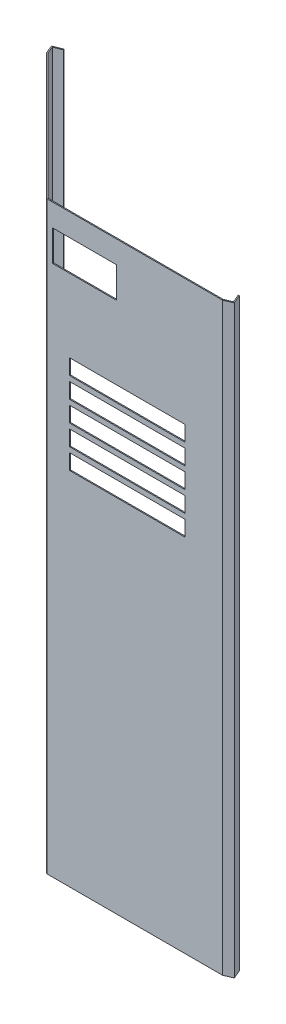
ISO-10303-21;
HEADER;
FILE_DESCRIPTION(('STEP AP214'),'2;1');
FILE_NAME('part.step','',(''),(''),'','','');
FILE_SCHEMA(('AUTOMOTIVE_DESIGN { 1 0 10303 214 1 1 1 1 }'));
ENDSEC;
DATA;
#1=APPLICATION_CONTEXT('core data for automotive mechanical design processes');
#2=APPLICATION_PROTOCOL_DEFINITION('international standard','automotive_design',2000,#1);
#3=PRODUCT_CONTEXT('',#1,'mechanical');
#4=PRODUCT('Part','Part','',(#3));
#5=PRODUCT_RELATED_PRODUCT_CATEGORY('part','',(#4));
#6=PRODUCT_DEFINITION_FORMATION('','',#4);
#7=PRODUCT_DEFINITION_CONTEXT('part definition',#1,'design');
#8=PRODUCT_DEFINITION('design','',#6,#7);
#9=PRODUCT_DEFINITION_SHAPE('','',#8);
#10=(LENGTH_UNIT() NAMED_UNIT(*) SI_UNIT(.MILLI.,.METRE.));
#11=(NAMED_UNIT(*) PLANE_ANGLE_UNIT() SI_UNIT($,.RADIAN.));
#12=(NAMED_UNIT(*) SI_UNIT($,.STERADIAN.) SOLID_ANGLE_UNIT());
#13=UNCERTAINTY_MEASURE_WITH_UNIT(LENGTH_MEASURE(1.E-05),#10,'distance_accuracy_value','');
#14=(GEOMETRIC_REPRESENTATION_CONTEXT(3) GLOBAL_UNCERTAINTY_ASSIGNED_CONTEXT((#13)) GLOBAL_UNIT_ASSIGNED_CONTEXT((#10,
#11,#12)) REPRESENTATION_CONTEXT('',''));
#15=CARTESIAN_POINT('',(0.,0.,0.));
#16=DIRECTION('',(0.,0.,1.));
#17=DIRECTION('',(1.,0.,0.));
#18=AXIS2_PLACEMENT_3D('',#15,#16,#17);
#19=CARTESIAN_POINT('',(-1188.05201732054,2276.,-520.181912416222));
#20=DIRECTION('',(-0.374606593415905,0.,-0.92718385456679));
#21=DIRECTION('',(-0.92718385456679,0.,0.374606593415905));
#22=AXIS2_PLACEMENT_3D('',#19,#20,#21);
#23=PLANE('',#22);
#24=DIRECTION('',(0.92718385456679,0.,-0.374606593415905));
#25=VECTOR('',#24,1.);
#26=CARTESIAN_POINT('',(-1188.05201732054,0.,-520.181912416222));
#27=LINE('',#26,#25);
#28=CARTESIAN_POINT('',(-1184.34328190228,0.,-521.680338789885));
#29=VERTEX_POINT('',#28);
#30=CARTESIAN_POINT('',(-1152.819030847,0.,-534.416962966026));
#31=VERTEX_POINT('',#30);
#32=EDGE_CURVE('E632',#29,#31,#27,.T.);
#33=ORIENTED_EDGE('',*,*,#32,.T.);
#34=DIRECTION('',(0.,-1.,0.));
#35=VECTOR('',#34,1.);
#36=CARTESIAN_POINT('',(-1152.819030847,2276.,-534.416962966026));
#37=LINE('',#36,#35);
#38=CARTESIAN_POINT('',(-1152.819030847,2276.,-534.416962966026));
#39=VERTEX_POINT('',#38);
#40=EDGE_CURVE('E738',#39,#31,#37,.T.);
#41=ORIENTED_EDGE('',*,*,#40,.F.);
#42=DIRECTION('',(0.92718385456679,0.,-0.374606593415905));
#43=VECTOR('',#42,1.);
#44=CARTESIAN_POINT('',(-1188.05201732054,2276.,-520.181912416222));
#45=LINE('',#44,#43);
#46=CARTESIAN_POINT('',(-1184.34328190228,2276.,-521.680338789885));
#47=VERTEX_POINT('',#46);
#48=EDGE_CURVE('E639',#47,#39,#45,.T.);
#49=ORIENTED_EDGE('',*,*,#48,.F.);
#50=DIRECTION('',(0.,-1.,0.));
#51=VECTOR('',#50,1.);
#52=CARTESIAN_POINT('',(-1184.34328190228,2276.,-521.680338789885));
#53=LINE('',#52,#51);
#54=EDGE_CURVE('E676',#47,#29,#53,.T.);
#55=ORIENTED_EDGE('',*,*,#54,.T.);
#56=EDGE_LOOP('',(#33,#41,#49,#55));
#57=FACE_BOUND('',#56,.T.);
#58=ADVANCED_FACE('F33',(#57),#23,.F.);
#59=CARTESIAN_POINT('',(-1154.31745722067,2276.,-538.125698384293));
#60=DIRECTION('',(0.927183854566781,0.,-0.374606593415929));
#61=DIRECTION('',(-0.374606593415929,0.,-0.927183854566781));
#62=AXIS2_PLACEMENT_3D('',#59,#60,#61);
#63=PLANE('',#62);
#64=DIRECTION('',(0.374606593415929,0.,0.927183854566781));
#65=VECTOR('',#64,1.);
#66=CARTESIAN_POINT('',(-1154.31745722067,0.,-538.125698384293));
#67=LINE('',#66,#65);
#68=CARTESIAN_POINT('',(-1154.31745722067,0.,-538.125698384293));
#69=VERTEX_POINT('',#68);
#70=EDGE_CURVE('E679',#69,#31,#67,.T.);
#71=ORIENTED_EDGE('',*,*,#70,.F.);
#72=DIRECTION('',(0.,-1.,0.));
#73=VECTOR('',#72,1.);
#74=CARTESIAN_POINT('',(-1154.31745722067,2276.,-538.125698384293));
#75=LINE('',#74,#73);
#76=CARTESIAN_POINT('',(-1154.31745722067,2276.,-538.125698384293));
#77=VERTEX_POINT('',#76);
#78=EDGE_CURVE('E736',#77,#69,#75,.T.);
#79=ORIENTED_EDGE('',*,*,#78,.F.);
#80=DIRECTION('',(0.374606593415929,0.,0.927183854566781));
#81=VECTOR('',#80,1.);
#82=CARTESIAN_POINT('',(-1154.31745722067,2276.,-538.125698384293));
#83=LINE('',#82,#81);
#84=EDGE_CURVE('E641',#77,#39,#83,.T.);
#85=ORIENTED_EDGE('',*,*,#84,.T.);
#86=ORIENTED_EDGE('',*,*,#40,.T.);
#87=EDGE_LOOP('',(#71,#79,#85,#86));
#88=FACE_BOUND('',#87,.T.);
#89=ADVANCED_FACE('F902',(#88),#63,.T.);
#90=CARTESIAN_POINT('',(-1189.55044369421,2276.,-523.890647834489));
#91=DIRECTION('',(-0.374606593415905,0.,-0.92718385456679));
#92=DIRECTION('',(-0.92718385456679,0.,0.374606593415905));
#93=AXIS2_PLACEMENT_3D('',#90,#91,#92);
#94=PLANE('',#93);
#95=DIRECTION('',(0.92718385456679,0.,-0.374606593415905));
#96=VECTOR('',#95,1.);
#97=CARTESIAN_POINT('',(-1189.55044369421,0.,-523.890647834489));
#98=LINE('',#97,#96);
#99=CARTESIAN_POINT('',(-1189.55044369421,0.,-523.890647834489));
#100=VERTEX_POINT('',#99);
#101=EDGE_CURVE('E682',#100,#69,#98,.T.);
#102=ORIENTED_EDGE('',*,*,#101,.F.);
#103=DIRECTION('',(0.,-1.,0.));
#104=VECTOR('',#103,1.);
#105=CARTESIAN_POINT('',(-1189.55044369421,2276.,-523.890647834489));
#106=LINE('',#105,#104);
#107=CARTESIAN_POINT('',(-1189.55044369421,2276.,-523.890647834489));
#108=VERTEX_POINT('',#107);
#109=EDGE_CURVE('E734',#108,#100,#106,.T.);
#110=ORIENTED_EDGE('',*,*,#109,.F.);
#111=DIRECTION('',(0.92718385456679,0.,-0.374606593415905));
#112=VECTOR('',#111,1.);
#113=CARTESIAN_POINT('',(-1189.55044369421,2276.,-523.890647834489));
#114=LINE('',#113,#112);
#115=EDGE_CURVE('E645',#108,#77,#114,.T.);
#116=ORIENTED_EDGE('',*,*,#115,.T.);
#117=ORIENTED_EDGE('',*,*,#78,.T.);
#118=EDGE_LOOP('',(#102,#110,#116,#117));
#119=FACE_BOUND('',#118,.T.);
#120=ADVANCED_FACE('F908',(#119),#94,.T.);
#121=CARTESIAN_POINT('',(-1176.43921292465,2276.,-491.439212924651));
#122=DIRECTION('',(-0.92718385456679,0.,0.374606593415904));
#123=DIRECTION('',(0.374606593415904,0.,0.927183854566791));
#124=AXIS2_PLACEMENT_3D('',#121,#122,#123);
#125=PLANE('',#124);
#126=DIRECTION('',(-0.374606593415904,0.,-0.92718385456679));
#127=VECTOR('',#126,1.);
#128=CARTESIAN_POINT('',(-1176.43921292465,0.,-491.439212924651));
#129=LINE('',#128,#127);
#130=CARTESIAN_POINT('',(-1176.43921292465,0.,-491.439212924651));
#131=VERTEX_POINT('',#130);
#132=EDGE_CURVE('E685',#131,#100,#129,.T.);
#133=ORIENTED_EDGE('',*,*,#132,.F.);
#134=DIRECTION('',(0.,-1.,0.));
#135=VECTOR('',#134,1.);
#136=CARTESIAN_POINT('',(-1176.43921292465,2276.,-491.439212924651));
#137=LINE('',#136,#135);
#138=CARTESIAN_POINT('',(-1176.43921292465,2276.,-491.439212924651));
#139=VERTEX_POINT('',#138);
#140=EDGE_CURVE('E731',#139,#131,#137,.T.);
#141=ORIENTED_EDGE('',*,*,#140,.F.);
#142=DIRECTION('',(-0.374606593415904,0.,-0.92718385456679));
#143=VECTOR('',#142,1.);
#144=CARTESIAN_POINT('',(-1176.43921292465,2276.,-491.439212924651));
#145=LINE('',#144,#143);
#146=EDGE_CURVE('E648',#139,#108,#145,.T.);
#147=ORIENTED_EDGE('',*,*,#146,.T.);
#148=ORIENTED_EDGE('',*,*,#109,.T.);
#149=EDGE_LOOP('',(#133,#141,#147,#148));
#150=FACE_BOUND('',#149,.T.);
#151=ADVANCED_FACE('F983',(#150),#125,.T.);
#152=CARTESIAN_POINT('',(-685.,2276.,0.));
#153=DIRECTION('',(-0.707106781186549,0.,0.707106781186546));
#154=DIRECTION('',(0.707106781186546,0.,0.707106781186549));
#155=AXIS2_PLACEMENT_3D('',#152,#153,#154);
#156=PLANE('',#155);
#157=DIRECTION('',(0.,-1.,0.));
#158=VECTOR('',#157,1.);
#159=CARTESIAN_POINT('',(-885.111219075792,1549.,-200.111219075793));
#160=LINE('',#159,#158);
#161=CARTESIAN_POINT('',(-885.111219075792,1549.,-200.111219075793));
#162=VERTEX_POINT('',#161);
#163=CARTESIAN_POINT('',(-885.111219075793,1429.,-200.111219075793));
#164=VERTEX_POINT('',#163);
#165=EDGE_CURVE('E48',#162,#164,#160,.T.);
#166=ORIENTED_EDGE('',*,*,#165,.F.);
#167=DIRECTION('',(-0.707106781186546,0.,-0.707106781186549));
#168=VECTOR('',#167,1.);
#169=CARTESIAN_POINT('',(-885.111219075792,1549.,-200.111219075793));
#170=LINE('',#169,#168);
#171=CARTESIAN_POINT('',(-708.334523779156,1549.,-23.3345237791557));
#172=VERTEX_POINT('',#171);
#173=EDGE_CURVE('E429',#172,#162,#170,.T.);
#174=ORIENTED_EDGE('',*,*,#173,.F.);
#175=DIRECTION('',(0.,1.,0.));
#176=VECTOR('',#175,1.);
#177=CARTESIAN_POINT('',(-708.334523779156,1549.,-23.3345237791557));
#178=LINE('',#177,#176);
#179=CARTESIAN_POINT('',(-708.334523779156,1429.,-23.3345237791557));
#180=VERTEX_POINT('',#179);
#181=EDGE_CURVE('E413',#180,#172,#178,.T.);
#182=ORIENTED_EDGE('',*,*,#181,.F.);
#183=DIRECTION('',(0.707106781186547,0.,0.707106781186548));
#184=VECTOR('',#183,1.);
#185=CARTESIAN_POINT('',(-885.111219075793,1429.,-200.111219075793));
#186=LINE('',#185,#184);
#187=EDGE_CURVE('E422',#164,#180,#186,.T.);
#188=ORIENTED_EDGE('',*,*,#187,.F.);
#189=EDGE_LOOP('',(#166,#174,#182,#188));
#190=FACE_BOUND('',#189,.T.);
#191=DIRECTION('',(0.,-1.,0.));
#192=VECTOR('',#191,1.);
#193=CARTESIAN_POINT('',(-1118.45645686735,1549.,-433.456456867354));
#194=LINE('',#193,#192);
#195=CARTESIAN_POINT('',(-1118.45645686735,1549.,-433.456456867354));
#196=VERTEX_POINT('',#195);
#197=CARTESIAN_POINT('',(-1118.45645686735,1429.,-433.456456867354));
#198=VERTEX_POINT('',#197);
#199=EDGE_CURVE('E436',#196,#198,#194,.T.);
#200=ORIENTED_EDGE('',*,*,#199,.F.);
#201=DIRECTION('',(-0.707106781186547,0.,-0.707106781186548));
#202=VECTOR('',#201,1.);
#203=CARTESIAN_POINT('',(-1118.45645686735,1549.,-433.456456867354));
#204=LINE('',#203,#202);
#205=CARTESIAN_POINT('',(-941.679761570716,1549.,-256.679761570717));
#206=VERTEX_POINT('',#205);
#207=EDGE_CURVE('E446',#206,#196,#204,.T.);
#208=ORIENTED_EDGE('',*,*,#207,.F.);
#209=DIRECTION('',(0.,1.,0.));
#210=VECTOR('',#209,1.);
#211=CARTESIAN_POINT('',(-941.679761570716,1549.,-256.679761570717));
#212=LINE('',#211,#210);
#213=CARTESIAN_POINT('',(-941.679761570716,1429.,-256.679761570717));
#214=VERTEX_POINT('',#213);
#215=EDGE_CURVE('E443',#214,#206,#212,.T.);
#216=ORIENTED_EDGE('',*,*,#215,.F.);
#217=DIRECTION('',(0.707106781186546,0.,0.707106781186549));
#218=VECTOR('',#217,1.);
#219=CARTESIAN_POINT('',(-1118.45645686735,1429.,-433.456456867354));
#220=LINE('',#219,#218);
#221=EDGE_CURVE('E440',#198,#214,#220,.T.);
#222=ORIENTED_EDGE('',*,*,#221,.F.);
#223=EDGE_LOOP('',(#200,#208,#216,#222));
#224=FACE_BOUND('',#223,.T.);
#225=DIRECTION('',(0.,-1.,0.));
#226=VECTOR('',#225,1.);
#227=CARTESIAN_POINT('',(-1118.45645686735,1869.,-433.456456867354));
#228=LINE('',#227,#226);
#229=CARTESIAN_POINT('',(-1118.45645686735,1869.,-433.456456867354));
#230=VERTEX_POINT('',#229);
#231=CARTESIAN_POINT('',(-1118.45645686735,1749.,-433.456456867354));
#232=VERTEX_POINT('',#231);
#233=EDGE_CURVE('E452',#230,#232,#228,.T.);
#234=ORIENTED_EDGE('',*,*,#233,.F.);
#235=DIRECTION('',(-0.707106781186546,0.,-0.707106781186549));
#236=VECTOR('',#235,1.);
#237=CARTESIAN_POINT('',(-1118.45645686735,1869.,-433.456456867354));
#238=LINE('',#237,#236);
#239=CARTESIAN_POINT('',(-941.679761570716,1869.,-256.679761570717));
#240=VERTEX_POINT('',#239);
#241=EDGE_CURVE('E466',#240,#230,#238,.T.);
#242=ORIENTED_EDGE('',*,*,#241,.F.);
#243=DIRECTION('',(0.,1.,0.));
#244=VECTOR('',#243,1.);
#245=CARTESIAN_POINT('',(-941.679761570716,1869.,-256.679761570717));
#246=LINE('',#245,#244);
#247=CARTESIAN_POINT('',(-941.679761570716,1749.,-256.679761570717));
#248=VERTEX_POINT('',#247);
#249=EDGE_CURVE('E463',#248,#240,#246,.T.);
#250=ORIENTED_EDGE('',*,*,#249,.F.);
#251=DIRECTION('',(0.707106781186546,0.,0.707106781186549));
#252=VECTOR('',#251,1.);
#253=CARTESIAN_POINT('',(-1118.45645686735,1749.,-433.456456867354));
#254=LINE('',#253,#252);
#255=EDGE_CURVE('E460',#232,#248,#254,.T.);
#256=ORIENTED_EDGE('',*,*,#255,.F.);
#257=EDGE_LOOP('',(#234,#242,#250,#256));
#258=FACE_BOUND('',#257,.T.);
#259=DIRECTION('',(0.,-1.,0.));
#260=VECTOR('',#259,1.);
#261=CARTESIAN_POINT('',(-885.111219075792,1869.,-200.111219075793));
#262=LINE('',#261,#260);
#263=CARTESIAN_POINT('',(-885.111219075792,1869.,-200.111219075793));
#264=VERTEX_POINT('',#263);
#265=CARTESIAN_POINT('',(-885.111219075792,1749.,-200.111219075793));
#266=VERTEX_POINT('',#265);
#267=EDGE_CURVE('E472',#264,#266,#262,.T.);
#268=ORIENTED_EDGE('',*,*,#267,.F.);
#269=DIRECTION('',(-0.707106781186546,0.,-0.707106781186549));
#270=VECTOR('',#269,1.);
#271=CARTESIAN_POINT('',(-885.111219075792,1869.,-200.111219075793));
#272=LINE('',#271,#270);
#273=CARTESIAN_POINT('',(-708.334523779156,1869.,-23.3345237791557));
#274=VERTEX_POINT('',#273);
#275=EDGE_CURVE('E486',#274,#264,#272,.T.);
#276=ORIENTED_EDGE('',*,*,#275,.F.);
#277=DIRECTION('',(0.,1.,0.));
#278=VECTOR('',#277,1.);
#279=CARTESIAN_POINT('',(-708.334523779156,1869.,-23.3345237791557));
#280=LINE('',#279,#278);
#281=CARTESIAN_POINT('',(-708.334523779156,1749.,-23.3345237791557));
#282=VERTEX_POINT('',#281);
#283=EDGE_CURVE('E483',#282,#274,#280,.T.);
#284=ORIENTED_EDGE('',*,*,#283,.F.);
#285=DIRECTION('',(0.707106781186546,0.,0.707106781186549));
#286=VECTOR('',#285,1.);
#287=CARTESIAN_POINT('',(-885.111219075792,1749.,-200.111219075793));
#288=LINE('',#287,#286);
#289=EDGE_CURVE('E480',#266,#282,#288,.T.);
#290=ORIENTED_EDGE('',*,*,#289,.F.);
#291=EDGE_LOOP('',(#268,#276,#284,#290));
#292=FACE_BOUND('',#291,.T.);
#293=DIRECTION('',(0.,-1.,0.));
#294=VECTOR('',#293,1.);
#295=CARTESIAN_POINT('',(-885.111219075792,2189.,-200.111219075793));
#296=LINE('',#295,#294);
#297=CARTESIAN_POINT('',(-885.111219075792,2189.,-200.111219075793));
#298=VERTEX_POINT('',#297);
#299=CARTESIAN_POINT('',(-885.111219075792,2069.,-200.111219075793));
#300=VERTEX_POINT('',#299);
#301=EDGE_CURVE('E492',#298,#300,#296,.T.);
#302=ORIENTED_EDGE('',*,*,#301,.F.);
#303=DIRECTION('',(-0.707106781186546,0.,-0.707106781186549));
#304=VECTOR('',#303,1.);
#305=CARTESIAN_POINT('',(-885.111219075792,2189.,-200.111219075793));
#306=LINE('',#305,#304);
#307=CARTESIAN_POINT('',(-708.334523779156,2189.,-23.3345237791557));
#308=VERTEX_POINT('',#307);
#309=EDGE_CURVE('E506',#308,#298,#306,.T.);
#310=ORIENTED_EDGE('',*,*,#309,.F.);
#311=DIRECTION('',(0.,1.,0.));
#312=VECTOR('',#311,1.);
#313=CARTESIAN_POINT('',(-708.334523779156,2189.,-23.3345237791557));
#314=LINE('',#313,#312);
#315=CARTESIAN_POINT('',(-708.334523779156,2069.,-23.3345237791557));
#316=VERTEX_POINT('',#315);
#317=EDGE_CURVE('E503',#316,#308,#314,.T.);
#318=ORIENTED_EDGE('',*,*,#317,.F.);
#319=DIRECTION('',(0.707106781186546,0.,0.707106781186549));
#320=VECTOR('',#319,1.);
#321=CARTESIAN_POINT('',(-885.111219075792,2069.,-200.111219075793));
#322=LINE('',#321,#320);
#323=EDGE_CURVE('E500',#300,#316,#322,.T.);
#324=ORIENTED_EDGE('',*,*,#323,.F.);
#325=EDGE_LOOP('',(#302,#310,#318,#324));
#326=FACE_BOUND('',#325,.T.);
#327=DIRECTION('',(-0.707106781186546,0.,-0.707106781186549));
#328=VECTOR('',#327,1.);
#329=CARTESIAN_POINT('',(-685.,0.,0.));
#330=LINE('',#329,#328);
#331=CARTESIAN_POINT('',(-686.171572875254,0.,-1.17157287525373));
#332=VERTEX_POINT('',#331);
#333=EDGE_CURVE('E688',#332,#131,#330,.T.);
#334=ORIENTED_EDGE('',*,*,#333,.F.);
#335=DIRECTION('',(0.,-1.,0.));
#336=VECTOR('',#335,1.);
#337=CARTESIAN_POINT('',(-686.171572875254,2276.,-1.17157287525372));
#338=LINE('',#337,#336);
#339=CARTESIAN_POINT('',(-686.171572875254,2276.,-1.17157287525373));
#340=VERTEX_POINT('',#339);
#341=EDGE_CURVE('E745',#332,#340,#338,.F.);
#342=ORIENTED_EDGE('',*,*,#341,.T.);
#343=DIRECTION('',(-0.707106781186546,0.,-0.707106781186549));
#344=VECTOR('',#343,1.);
#345=CARTESIAN_POINT('',(-685.,2276.,0.));
#346=LINE('',#345,#344);
#347=EDGE_CURVE('E651',#340,#139,#346,.T.);
#348=ORIENTED_EDGE('',*,*,#347,.T.);
#349=ORIENTED_EDGE('',*,*,#140,.T.);
#350=EDGE_LOOP('',(#334,#342,#348,#349));
#351=FACE_BOUND('',#350,.T.);
#352=ADVANCED_FACE('F426',(#190,#224,#258,#292,#326,#351),#156,.T.);
#353=CARTESIAN_POINT('',(0.,2276.,0.));
#354=DIRECTION('',(0.,0.,1.));
#355=DIRECTION('',(1.,0.,0.));
#356=AXIS2_PLACEMENT_3D('',#353,#354,#355);
#357=PLANE('',#356);
#358=DIRECTION('',(0.,-1.,0.));
#359=VECTOR('',#358,1.);
#360=CARTESIAN_POINT('',(-596.,1464.,0.));
#361=LINE('',#360,#359);
#362=CARTESIAN_POINT('',(-596.,1464.,0.));
#363=VERTEX_POINT('',#362);
#364=CARTESIAN_POINT('',(-596.,1404.,0.));
#365=VERTEX_POINT('',#364);
#366=EDGE_CURVE('E512',#363,#365,#361,.T.);
#367=ORIENTED_EDGE('',*,*,#366,.F.);
#368=DIRECTION('',(-1.,0.,0.));
#369=VECTOR('',#368,1.);
#370=CARTESIAN_POINT('',(-596.,1464.,0.));
#371=LINE('',#370,#369);
#372=CARTESIAN_POINT('',(-146.,1464.,0.));
#373=VERTEX_POINT('',#372);
#374=EDGE_CURVE('E526',#373,#363,#371,.T.);
#375=ORIENTED_EDGE('',*,*,#374,.F.);
#376=DIRECTION('',(0.,1.,0.));
#377=VECTOR('',#376,1.);
#378=CARTESIAN_POINT('',(-146.,1464.,0.));
#379=LINE('',#378,#377);
#380=CARTESIAN_POINT('',(-146.,1404.,0.));
#381=VERTEX_POINT('',#380);
#382=EDGE_CURVE('E523',#381,#373,#379,.T.);
#383=ORIENTED_EDGE('',*,*,#382,.F.);
#384=DIRECTION('',(1.,0.,0.));
#385=VECTOR('',#384,1.);
#386=CARTESIAN_POINT('',(-596.,1404.,0.));
#387=LINE('',#386,#385);
#388=EDGE_CURVE('E520',#365,#381,#387,.T.);
#389=ORIENTED_EDGE('',*,*,#388,.F.);
#390=EDGE_LOOP('',(#367,#375,#383,#389));
#391=FACE_BOUND('',#390,.T.);
#392=DIRECTION('',(0.,-1.,0.));
#393=VECTOR('',#392,1.);
#394=CARTESIAN_POINT('',(-596.,1544.,0.));
#395=LINE('',#394,#393);
#396=CARTESIAN_POINT('',(-596.,1544.,0.));
#397=VERTEX_POINT('',#396);
#398=CARTESIAN_POINT('',(-596.,1484.,0.));
#399=VERTEX_POINT('',#398);
#400=EDGE_CURVE('E532',#397,#399,#395,.T.);
#401=ORIENTED_EDGE('',*,*,#400,.F.);
#402=DIRECTION('',(-1.,0.,0.));
#403=VECTOR('',#402,1.);
#404=CARTESIAN_POINT('',(-596.,1544.,0.));
#405=LINE('',#404,#403);
#406=CARTESIAN_POINT('',(-146.,1544.,0.));
#407=VERTEX_POINT('',#406);
#408=EDGE_CURVE('E546',#407,#397,#405,.T.);
#409=ORIENTED_EDGE('',*,*,#408,.F.);
#410=DIRECTION('',(0.,1.,0.));
#411=VECTOR('',#410,1.);
#412=CARTESIAN_POINT('',(-146.,1544.,0.));
#413=LINE('',#412,#411);
#414=CARTESIAN_POINT('',(-146.,1484.,0.));
#415=VERTEX_POINT('',#414);
#416=EDGE_CURVE('E543',#415,#407,#413,.T.);
#417=ORIENTED_EDGE('',*,*,#416,.F.);
#418=DIRECTION('',(1.,0.,0.));
#419=VECTOR('',#418,1.);
#420=CARTESIAN_POINT('',(-596.,1484.,0.));
#421=LINE('',#420,#419);
#422=EDGE_CURVE('E540',#399,#415,#421,.T.);
#423=ORIENTED_EDGE('',*,*,#422,.F.);
#424=EDGE_LOOP('',(#401,#409,#417,#423));
#425=FACE_BOUND('',#424,.T.);
#426=DIRECTION('',(0.,-1.,0.));
#427=VECTOR('',#426,1.);
#428=CARTESIAN_POINT('',(-596.,1624.,0.));
#429=LINE('',#428,#427);
#430=CARTESIAN_POINT('',(-596.,1624.,0.));
#431=VERTEX_POINT('',#430);
#432=CARTESIAN_POINT('',(-596.,1564.,0.));
#433=VERTEX_POINT('',#432);
#434=EDGE_CURVE('E552',#431,#433,#429,.T.);
#435=ORIENTED_EDGE('',*,*,#434,.F.);
#436=DIRECTION('',(-1.,0.,0.));
#437=VECTOR('',#436,1.);
#438=CARTESIAN_POINT('',(-596.,1624.,0.));
#439=LINE('',#438,#437);
#440=CARTESIAN_POINT('',(-146.,1624.,0.));
#441=VERTEX_POINT('',#440);
#442=EDGE_CURVE('E566',#441,#431,#439,.T.);
#443=ORIENTED_EDGE('',*,*,#442,.F.);
#444=DIRECTION('',(0.,1.,0.));
#445=VECTOR('',#444,1.);
#446=CARTESIAN_POINT('',(-146.,1624.,0.));
#447=LINE('',#446,#445);
#448=CARTESIAN_POINT('',(-146.,1564.,0.));
#449=VERTEX_POINT('',#448);
#450=EDGE_CURVE('E563',#449,#441,#447,.T.);
#451=ORIENTED_EDGE('',*,*,#450,.F.);
#452=DIRECTION('',(1.,0.,0.));
#453=VECTOR('',#452,1.);
#454=CARTESIAN_POINT('',(-596.,1564.,0.));
#455=LINE('',#454,#453);
#456=EDGE_CURVE('E560',#433,#449,#455,.T.);
#457=ORIENTED_EDGE('',*,*,#456,.F.);
#458=EDGE_LOOP('',(#435,#443,#451,#457));
#459=FACE_BOUND('',#458,.T.);
#460=DIRECTION('',(0.,-1.,0.));
#461=VECTOR('',#460,1.);
#462=CARTESIAN_POINT('',(-596.,1704.,0.));
#463=LINE('',#462,#461);
#464=CARTESIAN_POINT('',(-596.,1704.,0.));
#465=VERTEX_POINT('',#464);
#466=CARTESIAN_POINT('',(-596.,1644.,0.));
#467=VERTEX_POINT('',#466);
#468=EDGE_CURVE('E572',#465,#467,#463,.T.);
#469=ORIENTED_EDGE('',*,*,#468,.F.);
#470=DIRECTION('',(-1.,0.,0.));
#471=VECTOR('',#470,1.);
#472=CARTESIAN_POINT('',(-596.,1704.,0.));
#473=LINE('',#472,#471);
#474=CARTESIAN_POINT('',(-146.,1704.,0.));
#475=VERTEX_POINT('',#474);
#476=EDGE_CURVE('E586',#475,#465,#473,.T.);
#477=ORIENTED_EDGE('',*,*,#476,.F.);
#478=DIRECTION('',(0.,1.,0.));
#479=VECTOR('',#478,1.);
#480=CARTESIAN_POINT('',(-146.,1704.,0.));
#481=LINE('',#480,#479);
#482=CARTESIAN_POINT('',(-146.,1644.,0.));
#483=VERTEX_POINT('',#482);
#484=EDGE_CURVE('E583',#483,#475,#481,.T.);
#485=ORIENTED_EDGE('',*,*,#484,.F.);
#486=DIRECTION('',(1.,0.,0.));
#487=VECTOR('',#486,1.);
#488=CARTESIAN_POINT('',(-596.,1644.,0.));
#489=LINE('',#488,#487);
#490=EDGE_CURVE('E580',#467,#483,#489,.T.);
#491=ORIENTED_EDGE('',*,*,#490,.F.);
#492=EDGE_LOOP('',(#469,#477,#485,#491));
#493=FACE_BOUND('',#492,.T.);
#494=DIRECTION('',(0.,-1.,0.));
#495=VECTOR('',#494,1.);
#496=CARTESIAN_POINT('',(-596.,1784.,0.));
#497=LINE('',#496,#495);
#498=CARTESIAN_POINT('',(-596.,1784.,0.));
#499=VERTEX_POINT('',#498);
#500=CARTESIAN_POINT('',(-596.,1724.,0.));
#501=VERTEX_POINT('',#500);
#502=EDGE_CURVE('E592',#499,#501,#497,.T.);
#503=ORIENTED_EDGE('',*,*,#502,.F.);
#504=DIRECTION('',(-1.,0.,0.));
#505=VECTOR('',#504,1.);
#506=CARTESIAN_POINT('',(-596.,1784.,0.));
#507=LINE('',#506,#505);
#508=CARTESIAN_POINT('',(-146.,1784.,0.));
#509=VERTEX_POINT('',#508);
#510=EDGE_CURVE('E606',#509,#499,#507,.T.);
#511=ORIENTED_EDGE('',*,*,#510,.F.);
#512=DIRECTION('',(0.,1.,0.));
#513=VECTOR('',#512,1.);
#514=CARTESIAN_POINT('',(-146.,1784.,0.));
#515=LINE('',#514,#513);
#516=CARTESIAN_POINT('',(-146.,1724.,0.));
#517=VERTEX_POINT('',#516);
#518=EDGE_CURVE('E603',#517,#509,#515,.T.);
#519=ORIENTED_EDGE('',*,*,#518,.F.);
#520=DIRECTION('',(1.,0.,0.));
#521=VECTOR('',#520,1.);
#522=CARTESIAN_POINT('',(-596.,1724.,0.));
#523=LINE('',#522,#521);
#524=EDGE_CURVE('E600',#501,#517,#523,.T.);
#525=ORIENTED_EDGE('',*,*,#524,.F.);
#526=EDGE_LOOP('',(#503,#511,#519,#525));
#527=FACE_BOUND('',#526,.T.);
#528=DIRECTION('',(0.,-1.,0.));
#529=VECTOR('',#528,1.);
#530=CARTESIAN_POINT('',(-662.,2189.,0.));
#531=LINE('',#530,#529);
#532=CARTESIAN_POINT('',(-662.,2189.,0.));
#533=VERTEX_POINT('',#532);
#534=CARTESIAN_POINT('',(-662.,2069.,0.));
#535=VERTEX_POINT('',#534);
#536=EDGE_CURVE('E612',#533,#535,#531,.T.);
#537=ORIENTED_EDGE('',*,*,#536,.F.);
#538=DIRECTION('',(-1.,0.,0.));
#539=VECTOR('',#538,1.);
#540=CARTESIAN_POINT('',(-662.,2189.,0.));
#541=LINE('',#540,#539);
#542=CARTESIAN_POINT('',(-412.,2189.,0.));
#543=VERTEX_POINT('',#542);
#544=EDGE_CURVE('E626',#543,#533,#541,.T.);
#545=ORIENTED_EDGE('',*,*,#544,.F.);
#546=DIRECTION('',(0.,1.,0.));
#547=VECTOR('',#546,1.);
#548=CARTESIAN_POINT('',(-412.,2189.,0.));
#549=LINE('',#548,#547);
#550=CARTESIAN_POINT('',(-412.,2069.,0.));
#551=VERTEX_POINT('',#550);
#552=EDGE_CURVE('E623',#551,#543,#549,.T.);
#553=ORIENTED_EDGE('',*,*,#552,.F.);
#554=DIRECTION('',(1.,0.,0.));
#555=VECTOR('',#554,1.);
#556=CARTESIAN_POINT('',(-662.,2069.,0.));
#557=LINE('',#556,#555);
#558=EDGE_CURVE('E620',#535,#551,#557,.T.);
#559=ORIENTED_EDGE('',*,*,#558,.F.);
#560=EDGE_LOOP('',(#537,#545,#553,#559));
#561=FACE_BOUND('',#560,.T.);
#562=DIRECTION('',(-1.,0.,0.));
#563=VECTOR('',#562,1.);
#564=CARTESIAN_POINT('',(0.,2276.,0.));
#565=LINE('',#564,#563);
#566=CARTESIAN_POINT('',(0.,2276.,0.));
#567=VERTEX_POINT('',#566);
#568=CARTESIAN_POINT('',(-683.343145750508,2276.,0.));
#569=VERTEX_POINT('',#568);
#570=EDGE_CURVE('E653',#567,#569,#565,.T.);
#571=ORIENTED_EDGE('',*,*,#570,.T.);
#572=DIRECTION('',(0.,-1.,0.));
#573=VECTOR('',#572,1.);
#574=CARTESIAN_POINT('',(-683.343145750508,2276.,0.));
#575=LINE('',#574,#573);
#576=CARTESIAN_POINT('',(-683.343145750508,0.,0.));
#577=VERTEX_POINT('',#576);
#578=EDGE_CURVE('E740',#569,#577,#575,.T.);
#579=ORIENTED_EDGE('',*,*,#578,.T.);
#580=DIRECTION('',(-1.,0.,0.));
#581=VECTOR('',#580,1.);
#582=CARTESIAN_POINT('',(0.,0.,0.));
#583=LINE('',#582,#581);
#584=CARTESIAN_POINT('',(0.,0.,0.));
#585=VERTEX_POINT('',#584);
#586=EDGE_CURVE('E690',#585,#577,#583,.T.);
#587=ORIENTED_EDGE('',*,*,#586,.F.);
#588=DIRECTION('',(0.,-1.,0.));
#589=VECTOR('',#588,1.);
#590=CARTESIAN_POINT('',(0.,2276.,0.));
#591=LINE('',#590,#589);
#592=EDGE_CURVE('E729',#567,#585,#591,.T.);
#593=ORIENTED_EDGE('',*,*,#592,.F.);
#594=EDGE_LOOP('',(#571,#579,#587,#593));
#595=FACE_BOUND('',#594,.T.);
#596=ADVANCED_FACE('F934',(#391,#425,#459,#493,#527,#561,#595),#357,.T.);
#597=CARTESIAN_POINT('',(0.,2276.,0.));
#598=DIRECTION('',(0.390731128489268,0.,0.920504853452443));
#599=DIRECTION('',(0.920504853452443,0.,-0.390731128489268));
#600=AXIS2_PLACEMENT_3D('',#597,#598,#599);
#601=PLANE('',#600);
#602=DIRECTION('',(-0.920504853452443,0.,0.390731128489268));
#603=VECTOR('',#602,1.);
#604=CARTESIAN_POINT('',(0.,0.,0.));
#605=LINE('',#604,#603);
#606=CARTESIAN_POINT('',(32.2176698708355,0.,-13.6755894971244));
#607=VERTEX_POINT('',#606);
#608=EDGE_CURVE('E693',#607,#585,#605,.T.);
#609=ORIENTED_EDGE('',*,*,#608,.F.);
#610=DIRECTION('',(0.,-1.,0.));
#611=VECTOR('',#610,1.);
#612=CARTESIAN_POINT('',(32.2176698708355,2276.,-13.6755894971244));
#613=LINE('',#612,#611);
#614=CARTESIAN_POINT('',(32.2176698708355,2276.,-13.6755894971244));
#615=VERTEX_POINT('',#614);
#616=EDGE_CURVE('E727',#615,#607,#613,.T.);
#617=ORIENTED_EDGE('',*,*,#616,.F.);
#618=DIRECTION('',(-0.920504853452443,0.,0.390731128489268));
#619=VECTOR('',#618,1.);
#620=CARTESIAN_POINT('',(0.,2276.,0.));
#621=LINE('',#620,#619);
#622=EDGE_CURVE('E656',#615,#567,#621,.T.);
#623=ORIENTED_EDGE('',*,*,#622,.T.);
#624=ORIENTED_EDGE('',*,*,#592,.T.);
#625=EDGE_LOOP('',(#609,#617,#623,#624));
#626=FACE_BOUND('',#625,.T.);
#627=ADVANCED_FACE('F938',(#626),#601,.T.);
#628=CARTESIAN_POINT('',(32.2176698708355,2276.,-13.6755894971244));
#629=DIRECTION('',(0.920504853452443,0.,-0.390731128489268));
#630=DIRECTION('',(-0.390731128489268,0.,-0.920504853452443));
#631=AXIS2_PLACEMENT_3D('',#628,#629,#630);
#632=PLANE('',#631);
#633=DIRECTION('',(0.390731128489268,0.,0.920504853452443));
#634=VECTOR('',#633,1.);
#635=CARTESIAN_POINT('',(32.2176698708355,0.,-13.6755894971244));
#636=LINE('',#635,#634);
#637=CARTESIAN_POINT('',(17.3698869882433,0.,-48.6547739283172));
#638=VERTEX_POINT('',#637);
#639=EDGE_CURVE('E696',#638,#607,#636,.T.);
#640=ORIENTED_EDGE('',*,*,#639,.F.);
#641=DIRECTION('',(0.,-1.,0.));
#642=VECTOR('',#641,1.);
#643=CARTESIAN_POINT('',(17.3698869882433,2276.,-48.6547739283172));
#644=LINE('',#643,#642);
#645=CARTESIAN_POINT('',(17.3698869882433,2276.,-48.6547739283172));
#646=VERTEX_POINT('',#645);
#647=EDGE_CURVE('E725',#646,#638,#644,.T.);
#648=ORIENTED_EDGE('',*,*,#647,.F.);
#649=DIRECTION('',(0.390731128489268,0.,0.920504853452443));
#650=VECTOR('',#649,1.);
#651=CARTESIAN_POINT('',(32.2176698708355,2276.,-13.6755894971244));
#652=LINE('',#651,#650);
#653=EDGE_CURVE('E659',#646,#615,#652,.T.);
#654=ORIENTED_EDGE('',*,*,#653,.T.);
#655=ORIENTED_EDGE('',*,*,#616,.T.);
#656=EDGE_LOOP('',(#640,#648,#654,#655));
#657=FACE_BOUND('',#656,.T.);
#658=ADVANCED_FACE('F943',(#657),#632,.T.);
#659=CARTESIAN_POINT('',(13.6878675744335,2276.,-47.0918494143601));
#660=DIRECTION('',(-0.390731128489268,0.,-0.920504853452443));
#661=DIRECTION('',(-0.920504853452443,0.,0.390731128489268));
#662=AXIS2_PLACEMENT_3D('',#659,#660,#661);
#663=PLANE('',#662);
#664=DIRECTION('',(0.920504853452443,0.,-0.390731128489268));
#665=VECTOR('',#664,1.);
#666=CARTESIAN_POINT('',(13.6878675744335,0.,-47.0918494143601));
#667=LINE('',#666,#665);
#668=CARTESIAN_POINT('',(13.6878675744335,0.,-47.0918494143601));
#669=VERTEX_POINT('',#668);
#670=EDGE_CURVE('E699',#669,#638,#667,.T.);
#671=ORIENTED_EDGE('',*,*,#670,.F.);
#672=DIRECTION('',(0.,-1.,0.));
#673=VECTOR('',#672,1.);
#674=CARTESIAN_POINT('',(13.6878675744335,2276.,-47.0918494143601));
#675=LINE('',#674,#673);
#676=CARTESIAN_POINT('',(13.6878675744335,2276.,-47.0918494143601));
#677=VERTEX_POINT('',#676);
#678=EDGE_CURVE('E723',#677,#669,#675,.T.);
#679=ORIENTED_EDGE('',*,*,#678,.F.);
#680=DIRECTION('',(0.920504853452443,0.,-0.390731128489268));
#681=VECTOR('',#680,1.);
#682=CARTESIAN_POINT('',(13.6878675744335,2276.,-47.0918494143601));
#683=LINE('',#682,#681);
#684=EDGE_CURVE('E662',#677,#646,#683,.T.);
#685=ORIENTED_EDGE('',*,*,#684,.T.);
#686=ORIENTED_EDGE('',*,*,#647,.T.);
#687=EDGE_LOOP('',(#671,#679,#685,#686));
#688=FACE_BOUND('',#687,.T.);
#689=ADVANCED_FACE('F946',(#688),#663,.T.);
#690=CARTESIAN_POINT('',(28.5356504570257,2276.,-12.1126649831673));
#691=DIRECTION('',(0.920504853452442,0.,-0.390731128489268));
#692=DIRECTION('',(-0.390731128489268,0.,-0.920504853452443));
#693=AXIS2_PLACEMENT_3D('',#690,#691,#692);
#694=PLANE('',#693);
#695=DIRECTION('',(0.390731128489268,0.,0.920504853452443));
#696=VECTOR('',#695,1.);
#697=CARTESIAN_POINT('',(28.5356504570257,0.,-12.1126649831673));
#698=LINE('',#697,#696);
#699=CARTESIAN_POINT('',(26.9727259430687,0.,-15.7946843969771));
#700=VERTEX_POINT('',#699);
#701=EDGE_CURVE('E702',#669,#700,#698,.T.);
#702=ORIENTED_EDGE('',*,*,#701,.T.);
#703=DIRECTION('',(0.,-1.,0.));
#704=VECTOR('',#703,1.);
#705=CARTESIAN_POINT('',(26.9727259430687,2276.,-15.7946843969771));
#706=LINE('',#705,#704);
#707=CARTESIAN_POINT('',(26.9727259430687,2276.,-15.7946843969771));
#708=VERTEX_POINT('',#707);
#709=EDGE_CURVE('E720',#708,#700,#706,.T.);
#710=ORIENTED_EDGE('',*,*,#709,.F.);
#711=DIRECTION('',(0.390731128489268,0.,0.920504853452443));
#712=VECTOR('',#711,1.);
#713=CARTESIAN_POINT('',(28.5356504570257,2276.,-12.1126649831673));
#714=LINE('',#713,#712);
#715=EDGE_CURVE('E665',#677,#708,#714,.T.);
#716=ORIENTED_EDGE('',*,*,#715,.F.);
#717=ORIENTED_EDGE('',*,*,#678,.T.);
#718=EDGE_LOOP('',(#702,#710,#716,#717));
#719=FACE_BOUND('',#718,.T.);
#720=ADVANCED_FACE('F952',(#719),#694,.F.);
#721=CARTESIAN_POINT('',(-1.56292451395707,2276.,-3.68201941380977));
#722=DIRECTION('',(0.390731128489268,0.,0.920504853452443));
#723=DIRECTION('',(0.920504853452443,0.,-0.390731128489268));
#724=AXIS2_PLACEMENT_3D('',#721,#722,#723);
#725=PLANE('',#724);
#726=DIRECTION('',(-0.920504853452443,0.,0.390731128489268));
#727=VECTOR('',#726,1.);
#728=CARTESIAN_POINT('',(-1.56292451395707,0.,-3.68201941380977));
#729=LINE('',#728,#727);
#730=CARTESIAN_POINT('',(-0.813809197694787,0.,-4.));
#731=VERTEX_POINT('',#730);
#732=EDGE_CURVE('E704',#700,#731,#729,.T.);
#733=ORIENTED_EDGE('',*,*,#732,.T.);
#734=DIRECTION('',(0.,-1.,0.));
#735=VECTOR('',#734,1.);
#736=CARTESIAN_POINT('',(-0.813809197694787,2276.,-4.));
#737=LINE('',#736,#735);
#738=CARTESIAN_POINT('',(-0.813809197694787,2276.,-4.));
#739=VERTEX_POINT('',#738);
#740=EDGE_CURVE('E717',#739,#731,#737,.T.);
#741=ORIENTED_EDGE('',*,*,#740,.F.);
#742=DIRECTION('',(-0.920504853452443,0.,0.390731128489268));
#743=VECTOR('',#742,1.);
#744=CARTESIAN_POINT('',(-1.56292451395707,2276.,-3.68201941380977));
#745=LINE('',#744,#743);
#746=EDGE_CURVE('E667',#708,#739,#745,.T.);
#747=ORIENTED_EDGE('',*,*,#746,.F.);
#748=ORIENTED_EDGE('',*,*,#709,.T.);
#749=EDGE_LOOP('',(#733,#741,#747,#748));
#750=FACE_BOUND('',#749,.T.);
#751=ADVANCED_FACE('F956',(#750),#725,.F.);
#752=CARTESIAN_POINT('',(0.,2276.,-4.));
#753=DIRECTION('',(0.,0.,1.));
#754=DIRECTION('',(1.,0.,0.));
#755=AXIS2_PLACEMENT_3D('',#752,#753,#754);
#756=PLANE('',#755);
#757=DIRECTION('',(-1.,0.,0.));
#758=VECTOR('',#757,1.);
#759=CARTESIAN_POINT('',(0.,1464.,-4.));
#760=LINE('',#759,#758);
#761=CARTESIAN_POINT('',(-146.,1464.,-4.));
#762=VERTEX_POINT('',#761);
#763=CARTESIAN_POINT('',(-596.,1464.,-4.));
#764=VERTEX_POINT('',#763);
#765=EDGE_CURVE('E824',#762,#764,#760,.T.);
#766=ORIENTED_EDGE('',*,*,#765,.T.);
#767=DIRECTION('',(0.,-1.,0.));
#768=VECTOR('',#767,1.);
#769=CARTESIAN_POINT('',(-596.,2276.,-3.99999999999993));
#770=LINE('',#769,#768);
#771=CARTESIAN_POINT('',(-596.,1404.,-4.));
#772=VERTEX_POINT('',#771);
#773=EDGE_CURVE('E827',#764,#772,#770,.T.);
#774=ORIENTED_EDGE('',*,*,#773,.T.);
#775=DIRECTION('',(1.,0.,0.));
#776=VECTOR('',#775,1.);
#777=CARTESIAN_POINT('',(0.,1404.,-4.));
#778=LINE('',#777,#776);
#779=CARTESIAN_POINT('',(-146.,1404.,-3.99999999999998));
#780=VERTEX_POINT('',#779);
#781=EDGE_CURVE('E818',#772,#780,#778,.T.);
#782=ORIENTED_EDGE('',*,*,#781,.T.);
#783=DIRECTION('',(0.,1.,0.));
#784=VECTOR('',#783,1.);
#785=CARTESIAN_POINT('',(-146.,2276.,-3.99999999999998));
#786=LINE('',#785,#784);
#787=EDGE_CURVE('E821',#780,#762,#786,.T.);
#788=ORIENTED_EDGE('',*,*,#787,.T.);
#789=EDGE_LOOP('',(#766,#774,#782,#788));
#790=FACE_BOUND('',#789,.T.);
#791=DIRECTION('',(-1.,0.,0.));
#792=VECTOR('',#791,1.);
#793=CARTESIAN_POINT('',(0.,1544.,-4.));
#794=LINE('',#793,#792);
#795=CARTESIAN_POINT('',(-146.,1544.,-4.));
#796=VERTEX_POINT('',#795);
#797=CARTESIAN_POINT('',(-596.,1544.,-4.));
#798=VERTEX_POINT('',#797);
#799=EDGE_CURVE('E812',#796,#798,#794,.T.);
#800=ORIENTED_EDGE('',*,*,#799,.T.);
#801=DIRECTION('',(0.,-1.,0.));
#802=VECTOR('',#801,1.);
#803=CARTESIAN_POINT('',(-596.,2276.,-3.99999999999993));
#804=LINE('',#803,#802);
#805=CARTESIAN_POINT('',(-596.,1484.,-4.));
#806=VERTEX_POINT('',#805);
#807=EDGE_CURVE('E815',#798,#806,#804,.T.);
#808=ORIENTED_EDGE('',*,*,#807,.T.);
#809=DIRECTION('',(1.,0.,0.));
#810=VECTOR('',#809,1.);
#811=CARTESIAN_POINT('',(0.,1484.,-4.));
#812=LINE('',#811,#810);
#813=CARTESIAN_POINT('',(-146.,1484.,-3.99999999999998));
#814=VERTEX_POINT('',#813);
#815=EDGE_CURVE('E806',#806,#814,#812,.T.);
#816=ORIENTED_EDGE('',*,*,#815,.T.);
#817=DIRECTION('',(0.,1.,0.));
#818=VECTOR('',#817,1.);
#819=CARTESIAN_POINT('',(-146.,2276.,-3.99999999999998));
#820=LINE('',#819,#818);
#821=EDGE_CURVE('E809',#814,#796,#820,.T.);
#822=ORIENTED_EDGE('',*,*,#821,.T.);
#823=EDGE_LOOP('',(#800,#808,#816,#822));
#824=FACE_BOUND('',#823,.T.);
#825=DIRECTION('',(-1.,0.,0.));
#826=VECTOR('',#825,1.);
#827=CARTESIAN_POINT('',(0.,1624.,-4.));
#828=LINE('',#827,#826);
#829=CARTESIAN_POINT('',(-146.,1624.,-4.));
#830=VERTEX_POINT('',#829);
#831=CARTESIAN_POINT('',(-596.,1624.,-4.));
#832=VERTEX_POINT('',#831);
#833=EDGE_CURVE('E800',#830,#832,#828,.T.);
#834=ORIENTED_EDGE('',*,*,#833,.T.);
#835=DIRECTION('',(0.,-1.,0.));
#836=VECTOR('',#835,1.);
#837=CARTESIAN_POINT('',(-596.,2276.,-3.99999999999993));
#838=LINE('',#837,#836);
#839=CARTESIAN_POINT('',(-596.,1564.,-4.));
#840=VERTEX_POINT('',#839);
#841=EDGE_CURVE('E803',#832,#840,#838,.T.);
#842=ORIENTED_EDGE('',*,*,#841,.T.);
#843=DIRECTION('',(1.,0.,0.));
#844=VECTOR('',#843,1.);
#845=CARTESIAN_POINT('',(0.,1564.,-4.));
#846=LINE('',#845,#844);
#847=CARTESIAN_POINT('',(-146.,1564.,-3.99999999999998));
#848=VERTEX_POINT('',#847);
#849=EDGE_CURVE('E794',#840,#848,#846,.T.);
#850=ORIENTED_EDGE('',*,*,#849,.T.);
#851=DIRECTION('',(0.,1.,0.));
#852=VECTOR('',#851,1.);
#853=CARTESIAN_POINT('',(-146.,2276.,-3.99999999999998));
#854=LINE('',#853,#852);
#855=EDGE_CURVE('E797',#848,#830,#854,.T.);
#856=ORIENTED_EDGE('',*,*,#855,.T.);
#857=EDGE_LOOP('',(#834,#842,#850,#856));
#858=FACE_BOUND('',#857,.T.);
#859=DIRECTION('',(-1.,0.,0.));
#860=VECTOR('',#859,1.);
#861=CARTESIAN_POINT('',(0.,1704.,-4.));
#862=LINE('',#861,#860);
#863=CARTESIAN_POINT('',(-146.,1704.,-4.));
#864=VERTEX_POINT('',#863);
#865=CARTESIAN_POINT('',(-596.,1704.,-4.));
#866=VERTEX_POINT('',#865);
#867=EDGE_CURVE('E788',#864,#866,#862,.T.);
#868=ORIENTED_EDGE('',*,*,#867,.T.);
#869=DIRECTION('',(0.,-1.,0.));
#870=VECTOR('',#869,1.);
#871=CARTESIAN_POINT('',(-596.000000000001,2276.,-3.99999999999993));
#872=LINE('',#871,#870);
#873=CARTESIAN_POINT('',(-596.,1644.,-4.));
#874=VERTEX_POINT('',#873);
#875=EDGE_CURVE('E791',#866,#874,#872,.T.);
#876=ORIENTED_EDGE('',*,*,#875,.T.);
#877=DIRECTION('',(1.,0.,0.));
#878=VECTOR('',#877,1.);
#879=CARTESIAN_POINT('',(0.,1644.,-4.));
#880=LINE('',#879,#878);
#881=CARTESIAN_POINT('',(-146.,1644.,-3.99999999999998));
#882=VERTEX_POINT('',#881);
#883=EDGE_CURVE('E782',#874,#882,#880,.T.);
#884=ORIENTED_EDGE('',*,*,#883,.T.);
#885=DIRECTION('',(0.,1.,0.));
#886=VECTOR('',#885,1.);
#887=CARTESIAN_POINT('',(-146.,2276.,-3.99999999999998));
#888=LINE('',#887,#886);
#889=EDGE_CURVE('E785',#882,#864,#888,.T.);
#890=ORIENTED_EDGE('',*,*,#889,.T.);
#891=EDGE_LOOP('',(#868,#876,#884,#890));
#892=FACE_BOUND('',#891,.T.);
#893=DIRECTION('',(-1.,0.,0.));
#894=VECTOR('',#893,1.);
#895=CARTESIAN_POINT('',(-2.43258626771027E-13,1784.,-4.));
#896=LINE('',#895,#894);
#897=CARTESIAN_POINT('',(-146.,1784.,-4.));
#898=VERTEX_POINT('',#897);
#899=CARTESIAN_POINT('',(-596.,1784.,-4.));
#900=VERTEX_POINT('',#899);
#901=EDGE_CURVE('E776',#898,#900,#896,.T.);
#902=ORIENTED_EDGE('',*,*,#901,.T.);
#903=DIRECTION('',(0.,-1.,0.));
#904=VECTOR('',#903,1.);
#905=CARTESIAN_POINT('',(-595.999999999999,2276.,-3.99999999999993));
#906=LINE('',#905,#904);
#907=CARTESIAN_POINT('',(-596.,1724.,-4.));
#908=VERTEX_POINT('',#907);
#909=EDGE_CURVE('E779',#900,#908,#906,.T.);
#910=ORIENTED_EDGE('',*,*,#909,.T.);
#911=DIRECTION('',(1.,0.,0.));
#912=VECTOR('',#911,1.);
#913=CARTESIAN_POINT('',(0.,1724.,-4.));
#914=LINE('',#913,#912);
#915=CARTESIAN_POINT('',(-146.,1724.,-3.99999999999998));
#916=VERTEX_POINT('',#915);
#917=EDGE_CURVE('E770',#908,#916,#914,.T.);
#918=ORIENTED_EDGE('',*,*,#917,.T.);
#919=DIRECTION('',(0.,1.,0.));
#920=VECTOR('',#919,1.);
#921=CARTESIAN_POINT('',(-146.000000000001,2276.,-3.99999999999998));
#922=LINE('',#921,#920);
#923=EDGE_CURVE('E773',#916,#898,#922,.T.);
#924=ORIENTED_EDGE('',*,*,#923,.T.);
#925=EDGE_LOOP('',(#902,#910,#918,#924));
#926=FACE_BOUND('',#925,.T.);
#927=DIRECTION('',(-1.,0.,0.));
#928=VECTOR('',#927,1.);
#929=CARTESIAN_POINT('',(0.,2189.,-4.));
#930=LINE('',#929,#928);
#931=CARTESIAN_POINT('',(-412.,2189.,-4.));
#932=VERTEX_POINT('',#931);
#933=CARTESIAN_POINT('',(-662.,2189.,-3.99999999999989));
#934=VERTEX_POINT('',#933);
#935=EDGE_CURVE('E764',#932,#934,#930,.T.);
#936=ORIENTED_EDGE('',*,*,#935,.T.);
#937=DIRECTION('',(0.,-1.,0.));
#938=VECTOR('',#937,1.);
#939=CARTESIAN_POINT('',(-662.,2276.,-3.99999999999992));
#940=LINE('',#939,#938);
#941=CARTESIAN_POINT('',(-662.,2069.,-3.99999999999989));
#942=VERTEX_POINT('',#941);
#943=EDGE_CURVE('E767',#934,#942,#940,.T.);
#944=ORIENTED_EDGE('',*,*,#943,.T.);
#945=DIRECTION('',(1.,0.,0.));
#946=VECTOR('',#945,1.);
#947=CARTESIAN_POINT('',(0.,2069.,-4.));
#948=LINE('',#947,#946);
#949=CARTESIAN_POINT('',(-412.,2069.,-3.99999999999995));
#950=VERTEX_POINT('',#949);
#951=EDGE_CURVE('E758',#942,#950,#948,.T.);
#952=ORIENTED_EDGE('',*,*,#951,.T.);
#953=DIRECTION('',(0.,1.,0.));
#954=VECTOR('',#953,1.);
#955=CARTESIAN_POINT('',(-412.,2276.,-3.99999999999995));
#956=LINE('',#955,#954);
#957=EDGE_CURVE('E761',#950,#932,#956,.T.);
#958=ORIENTED_EDGE('',*,*,#957,.T.);
#959=EDGE_LOOP('',(#936,#944,#952,#958));
#960=FACE_BOUND('',#959,.T.);
#961=DIRECTION('',(-1.,0.,0.));
#962=VECTOR('',#961,1.);
#963=CARTESIAN_POINT('',(0.,0.,-4.));
#964=LINE('',#963,#962);
#965=CARTESIAN_POINT('',(-682.514718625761,0.,-3.99999999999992));
#966=VERTEX_POINT('',#965);
#967=EDGE_CURVE('E706',#731,#966,#964,.T.);
#968=ORIENTED_EDGE('',*,*,#967,.T.);
#969=DIRECTION('',(0.,-1.,0.));
#970=VECTOR('',#969,1.);
#971=CARTESIAN_POINT('',(-682.514718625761,2276.,-3.99999999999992));
#972=LINE('',#971,#970);
#973=CARTESIAN_POINT('',(-682.514718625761,2276.,-3.99999999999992));
#974=VERTEX_POINT('',#973);
#975=EDGE_CURVE('E752',#966,#974,#972,.F.);
#976=ORIENTED_EDGE('',*,*,#975,.T.);
#977=DIRECTION('',(-1.,0.,0.));
#978=VECTOR('',#977,1.);
#979=CARTESIAN_POINT('',(0.,2276.,-4.));
#980=LINE('',#979,#978);
#981=EDGE_CURVE('E669',#739,#974,#980,.T.);
#982=ORIENTED_EDGE('',*,*,#981,.F.);
#983=ORIENTED_EDGE('',*,*,#740,.T.);
#984=EDGE_LOOP('',(#968,#976,#982,#983));
#985=FACE_BOUND('',#984,.T.);
#986=ADVANCED_FACE('F960',(#790,#824,#858,#892,#926,#960,#985),#756,.F.);
#987=CARTESIAN_POINT('',(-682.171572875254,2276.,-2.8284271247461));
#988=DIRECTION('',(-0.707106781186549,0.,0.707106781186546));
#989=DIRECTION('',(0.707106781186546,0.,0.707106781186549));
#990=AXIS2_PLACEMENT_3D('',#987,#988,#989);
#991=PLANE('',#990);
#992=DIRECTION('',(-0.707106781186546,0.,-0.707106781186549));
#993=VECTOR('',#992,1.);
#994=CARTESIAN_POINT('',(-682.171572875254,1549.,-2.8284271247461));
#995=LINE('',#994,#993);
#996=CARTESIAN_POINT('',(-705.50609665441,1549.,-26.162950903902));
#997=VERTEX_POINT('',#996);
#998=CARTESIAN_POINT('',(-882.282791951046,1549.,-202.939646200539));
#999=VERTEX_POINT('',#998);
#1000=EDGE_CURVE('E41',#997,#999,#995,.T.);
#1001=ORIENTED_EDGE('',*,*,#1000,.T.);
#1002=DIRECTION('',(0.,-1.,0.));
#1003=VECTOR('',#1002,1.);
#1004=CARTESIAN_POINT('',(-882.282791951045,2276.,-202.939646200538));
#1005=LINE('',#1004,#1003);
#1006=CARTESIAN_POINT('',(-882.282791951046,1429.,-202.939646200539));
#1007=VERTEX_POINT('',#1006);
#1008=EDGE_CURVE('E11',#999,#1007,#1005,.T.);
#1009=ORIENTED_EDGE('',*,*,#1008,.T.);
#1010=DIRECTION('',(0.707106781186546,0.,0.707106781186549));
#1011=VECTOR('',#1010,1.);
#1012=CARTESIAN_POINT('',(-682.171572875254,1429.,-2.8284271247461));
#1013=LINE('',#1012,#1011);
#1014=CARTESIAN_POINT('',(-705.50609665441,1429.,-26.1629509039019));
#1015=VERTEX_POINT('',#1014);
#1016=EDGE_CURVE('E878',#1007,#1015,#1013,.T.);
#1017=ORIENTED_EDGE('',*,*,#1016,.T.);
#1018=DIRECTION('',(0.,1.,0.));
#1019=VECTOR('',#1018,1.);
#1020=CARTESIAN_POINT('',(-705.50609665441,2276.,-26.1629509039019));
#1021=LINE('',#1020,#1019);
#1022=EDGE_CURVE('E416',#1015,#997,#1021,.T.);
#1023=ORIENTED_EDGE('',*,*,#1022,.T.);
#1024=EDGE_LOOP('',(#1001,#1009,#1017,#1023));
#1025=FACE_BOUND('',#1024,.T.);
#1026=DIRECTION('',(-0.707106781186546,0.,-0.707106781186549));
#1027=VECTOR('',#1026,1.);
#1028=CARTESIAN_POINT('',(-682.171572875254,1549.,-2.8284271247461));
#1029=LINE('',#1028,#1027);
#1030=CARTESIAN_POINT('',(-938.85133444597,1549.,-259.508188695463));
#1031=VERTEX_POINT('',#1030);
#1032=CARTESIAN_POINT('',(-1115.62802974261,1549.,-436.2848839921));
#1033=VERTEX_POINT('',#1032);
#1034=EDGE_CURVE('E872',#1031,#1033,#1029,.T.);
#1035=ORIENTED_EDGE('',*,*,#1034,.T.);
#1036=DIRECTION('',(0.,-1.,0.));
#1037=VECTOR('',#1036,1.);
#1038=CARTESIAN_POINT('',(-1115.62802974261,2276.,-436.2848839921));
#1039=LINE('',#1038,#1037);
#1040=CARTESIAN_POINT('',(-1115.62802974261,1429.,-436.2848839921));
#1041=VERTEX_POINT('',#1040);
#1042=EDGE_CURVE('E875',#1033,#1041,#1039,.T.);
#1043=ORIENTED_EDGE('',*,*,#1042,.T.);
#1044=DIRECTION('',(0.707106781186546,0.,0.707106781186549));
#1045=VECTOR('',#1044,1.);
#1046=CARTESIAN_POINT('',(-682.171572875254,1429.,-2.8284271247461));
#1047=LINE('',#1046,#1045);
#1048=CARTESIAN_POINT('',(-938.85133444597,1429.,-259.508188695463));
#1049=VERTEX_POINT('',#1048);
#1050=EDGE_CURVE('E866',#1041,#1049,#1047,.T.);
#1051=ORIENTED_EDGE('',*,*,#1050,.T.);
#1052=DIRECTION('',(0.,1.,0.));
#1053=VECTOR('',#1052,1.);
#1054=CARTESIAN_POINT('',(-938.851334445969,2276.,-259.508188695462));
#1055=LINE('',#1054,#1053);
#1056=EDGE_CURVE('E869',#1049,#1031,#1055,.T.);
#1057=ORIENTED_EDGE('',*,*,#1056,.T.);
#1058=EDGE_LOOP('',(#1035,#1043,#1051,#1057));
#1059=FACE_BOUND('',#1058,.T.);
#1060=DIRECTION('',(-0.707106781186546,0.,-0.707106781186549));
#1061=VECTOR('',#1060,1.);
#1062=CARTESIAN_POINT('',(-682.171572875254,1869.,-2.8284271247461));
#1063=LINE('',#1062,#1061);
#1064=CARTESIAN_POINT('',(-938.85133444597,1869.,-259.508188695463));
#1065=VERTEX_POINT('',#1064);
#1066=CARTESIAN_POINT('',(-1115.62802974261,1869.,-436.2848839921));
#1067=VERTEX_POINT('',#1066);
#1068=EDGE_CURVE('E860',#1065,#1067,#1063,.T.);
#1069=ORIENTED_EDGE('',*,*,#1068,.T.);
#1070=DIRECTION('',(0.,-1.,0.));
#1071=VECTOR('',#1070,1.);
#1072=CARTESIAN_POINT('',(-1115.62802974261,2276.,-436.2848839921));
#1073=LINE('',#1072,#1071);
#1074=CARTESIAN_POINT('',(-1115.62802974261,1749.,-436.2848839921));
#1075=VERTEX_POINT('',#1074);
#1076=EDGE_CURVE('E863',#1067,#1075,#1073,.T.);
#1077=ORIENTED_EDGE('',*,*,#1076,.T.);
#1078=DIRECTION('',(0.707106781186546,0.,0.707106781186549));
#1079=VECTOR('',#1078,1.);
#1080=CARTESIAN_POINT('',(-682.171572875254,1749.,-2.8284271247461));
#1081=LINE('',#1080,#1079);
#1082=CARTESIAN_POINT('',(-938.85133444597,1749.,-259.508188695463));
#1083=VERTEX_POINT('',#1082);
#1084=EDGE_CURVE('E854',#1075,#1083,#1081,.T.);
#1085=ORIENTED_EDGE('',*,*,#1084,.T.);
#1086=DIRECTION('',(0.,1.,0.));
#1087=VECTOR('',#1086,1.);
#1088=CARTESIAN_POINT('',(-938.85133444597,2276.,-259.508188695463));
#1089=LINE('',#1088,#1087);
#1090=EDGE_CURVE('E857',#1083,#1065,#1089,.T.);
#1091=ORIENTED_EDGE('',*,*,#1090,.T.);
#1092=EDGE_LOOP('',(#1069,#1077,#1085,#1091));
#1093=FACE_BOUND('',#1092,.T.);
#1094=DIRECTION('',(-0.707106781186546,0.,-0.707106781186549));
#1095=VECTOR('',#1094,1.);
#1096=CARTESIAN_POINT('',(-682.171572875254,1869.,-2.8284271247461));
#1097=LINE('',#1096,#1095);
#1098=CARTESIAN_POINT('',(-705.50609665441,1869.,-26.162950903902));
#1099=VERTEX_POINT('',#1098);
#1100=CARTESIAN_POINT('',(-882.282791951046,1869.,-202.939646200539));
#1101=VERTEX_POINT('',#1100);
#1102=EDGE_CURVE('E848',#1099,#1101,#1097,.T.);
#1103=ORIENTED_EDGE('',*,*,#1102,.T.);
#1104=DIRECTION('',(0.,-1.,0.));
#1105=VECTOR('',#1104,1.);
#1106=CARTESIAN_POINT('',(-882.282791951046,2276.,-202.939646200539));
#1107=LINE('',#1106,#1105);
#1108=CARTESIAN_POINT('',(-882.282791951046,1749.,-202.939646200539));
#1109=VERTEX_POINT('',#1108);
#1110=EDGE_CURVE('E851',#1101,#1109,#1107,.T.);
#1111=ORIENTED_EDGE('',*,*,#1110,.T.);
#1112=DIRECTION('',(0.707106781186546,0.,0.707106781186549));
#1113=VECTOR('',#1112,1.);
#1114=CARTESIAN_POINT('',(-682.171572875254,1749.,-2.8284271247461));
#1115=LINE('',#1114,#1113);
#1116=CARTESIAN_POINT('',(-705.50609665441,1749.,-26.1629509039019));
#1117=VERTEX_POINT('',#1116);
#1118=EDGE_CURVE('E842',#1109,#1117,#1115,.T.);
#1119=ORIENTED_EDGE('',*,*,#1118,.T.);
#1120=DIRECTION('',(0.,1.,0.));
#1121=VECTOR('',#1120,1.);
#1122=CARTESIAN_POINT('',(-705.50609665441,2276.,-26.1629509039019));
#1123=LINE('',#1122,#1121);
#1124=EDGE_CURVE('E845',#1117,#1099,#1123,.T.);
#1125=ORIENTED_EDGE('',*,*,#1124,.T.);
#1126=EDGE_LOOP('',(#1103,#1111,#1119,#1125));
#1127=FACE_BOUND('',#1126,.T.);
#1128=DIRECTION('',(-0.707106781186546,0.,-0.707106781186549));
#1129=VECTOR('',#1128,1.);
#1130=CARTESIAN_POINT('',(-682.171572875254,2189.,-2.8284271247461));
#1131=LINE('',#1130,#1129);
#1132=CARTESIAN_POINT('',(-705.50609665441,2189.,-26.162950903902));
#1133=VERTEX_POINT('',#1132);
#1134=CARTESIAN_POINT('',(-882.282791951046,2189.,-202.939646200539));
#1135=VERTEX_POINT('',#1134);
#1136=EDGE_CURVE('E836',#1133,#1135,#1131,.T.);
#1137=ORIENTED_EDGE('',*,*,#1136,.T.);
#1138=DIRECTION('',(0.,-1.,0.));
#1139=VECTOR('',#1138,1.);
#1140=CARTESIAN_POINT('',(-882.282791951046,2276.,-202.939646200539));
#1141=LINE('',#1140,#1139);
#1142=CARTESIAN_POINT('',(-882.282791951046,2069.,-202.939646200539));
#1143=VERTEX_POINT('',#1142);
#1144=EDGE_CURVE('E839',#1135,#1143,#1141,.T.);
#1145=ORIENTED_EDGE('',*,*,#1144,.T.);
#1146=DIRECTION('',(0.707106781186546,0.,0.707106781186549));
#1147=VECTOR('',#1146,1.);
#1148=CARTESIAN_POINT('',(-682.171572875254,2069.,-2.8284271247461));
#1149=LINE('',#1148,#1147);
#1150=CARTESIAN_POINT('',(-705.50609665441,2069.,-26.1629509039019));
#1151=VERTEX_POINT('',#1150);
#1152=EDGE_CURVE('E830',#1143,#1151,#1149,.T.);
#1153=ORIENTED_EDGE('',*,*,#1152,.T.);
#1154=DIRECTION('',(0.,1.,0.));
#1155=VECTOR('',#1154,1.);
#1156=CARTESIAN_POINT('',(-705.50609665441,2276.,-26.1629509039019));
#1157=LINE('',#1156,#1155);
#1158=EDGE_CURVE('E833',#1151,#1133,#1157,.T.);
#1159=ORIENTED_EDGE('',*,*,#1158,.T.);
#1160=EDGE_LOOP('',(#1137,#1145,#1153,#1159));
#1161=FACE_BOUND('',#1160,.T.);
#1162=DIRECTION('',(-0.707106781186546,0.,-0.707106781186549));
#1163=VECTOR('',#1162,1.);
#1164=CARTESIAN_POINT('',(-682.171572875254,2276.,-2.8284271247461));
#1165=LINE('',#1164,#1163);
#1166=CARTESIAN_POINT('',(-683.928932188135,2276.,-4.58578643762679));
#1167=VERTEX_POINT('',#1166);
#1168=CARTESIAN_POINT('',(-1173.03533579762,2276.,-493.692190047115));
#1169=VERTEX_POINT('',#1168);
#1170=EDGE_CURVE('E672',#1167,#1169,#1165,.T.);
#1171=ORIENTED_EDGE('',*,*,#1170,.F.);
#1172=DIRECTION('',(0.,-1.,0.));
#1173=VECTOR('',#1172,1.);
#1174=CARTESIAN_POINT('',(-683.928932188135,0.,-4.58578643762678));
#1175=LINE('',#1174,#1173);
#1176=CARTESIAN_POINT('',(-683.928932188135,0.,-4.58578643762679));
#1177=VERTEX_POINT('',#1176);
#1178=EDGE_CURVE('E749',#1167,#1177,#1175,.T.);
#1179=ORIENTED_EDGE('',*,*,#1178,.T.);
#1180=DIRECTION('',(-0.707106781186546,0.,-0.707106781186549));
#1181=VECTOR('',#1180,1.);
#1182=CARTESIAN_POINT('',(-682.171572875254,0.,-2.8284271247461));
#1183=LINE('',#1182,#1181);
#1184=CARTESIAN_POINT('',(-1173.03533579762,0.,-493.692190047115));
#1185=VERTEX_POINT('',#1184);
#1186=EDGE_CURVE('E709',#1177,#1185,#1183,.T.);
#1187=ORIENTED_EDGE('',*,*,#1186,.T.);
#1188=DIRECTION('',(0.,-1.,0.));
#1189=VECTOR('',#1188,1.);
#1190=CARTESIAN_POINT('',(-1173.03533579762,2276.,-493.692190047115));
#1191=LINE('',#1190,#1189);
#1192=EDGE_CURVE('E714',#1169,#1185,#1191,.T.);
#1193=ORIENTED_EDGE('',*,*,#1192,.F.);
#1194=EDGE_LOOP('',(#1171,#1179,#1187,#1193));
#1195=FACE_BOUND('',#1194,.T.);
#1196=ADVANCED_FACE('F882',(#1025,#1059,#1093,#1127,#1161,#1195),#991,.F.);
#1197=CARTESIAN_POINT('',(-1172.73047750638,2276.,-492.937639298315));
#1198=DIRECTION('',(-0.927183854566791,0.,0.374606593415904));
#1199=DIRECTION('',(0.374606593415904,0.,0.927183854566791));
#1200=AXIS2_PLACEMENT_3D('',#1197,#1198,#1199);
#1201=PLANE('',#1200);
#1202=DIRECTION('',(-0.374606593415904,0.,-0.927183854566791));
#1203=VECTOR('',#1202,1.);
#1204=CARTESIAN_POINT('',(-1172.73047750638,0.,-492.937639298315));
#1205=LINE('',#1204,#1203);
#1206=EDGE_CURVE('E642',#1185,#29,#1205,.T.);
#1207=ORIENTED_EDGE('',*,*,#1206,.T.);
#1208=ORIENTED_EDGE('',*,*,#54,.F.);
#1209=DIRECTION('',(-0.374606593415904,0.,-0.927183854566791));
#1210=VECTOR('',#1209,1.);
#1211=CARTESIAN_POINT('',(-1172.73047750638,2276.,-492.937639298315));
#1212=LINE('',#1211,#1210);
#1213=EDGE_CURVE('E674',#1169,#47,#1212,.T.);
#1214=ORIENTED_EDGE('',*,*,#1213,.F.);
#1215=ORIENTED_EDGE('',*,*,#1192,.T.);
#1216=EDGE_LOOP('',(#1207,#1208,#1214,#1215));
#1217=FACE_BOUND('',#1216,.T.);
#1218=ADVANCED_FACE('F972',(#1217),#1201,.F.);
#1219=CARTESIAN_POINT('',(-1152.819030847,2276.,-534.416962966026));
#1220=DIRECTION('',(0.,-1.,0.));
#1221=DIRECTION('',(-1.,0.,0.));
#1222=AXIS2_PLACEMENT_3D('',#1219,#1220,#1221);
#1223=PLANE('',#1222);
#1224=ORIENTED_EDGE('',*,*,#347,.F.);
#1225=CARTESIAN_POINT('',(-683.343145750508,2276.,-3.99999999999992));
#1226=DIRECTION('',(0.,-1.,0.));
#1227=DIRECTION('',(0.,0.,-1.));
#1228=AXIS2_PLACEMENT_3D('',#1225,#1226,#1227);
#1229=CIRCLE('',#1228,4.);
#1230=EDGE_CURVE('E747',#340,#569,#1229,.F.);
#1231=ORIENTED_EDGE('',*,*,#1230,.T.);
#1232=ORIENTED_EDGE('',*,*,#570,.F.);
#1233=ORIENTED_EDGE('',*,*,#622,.F.);
#1234=ORIENTED_EDGE('',*,*,#653,.F.);
#1235=ORIENTED_EDGE('',*,*,#684,.F.);
#1236=ORIENTED_EDGE('',*,*,#715,.T.);
#1237=ORIENTED_EDGE('',*,*,#746,.T.);
#1238=ORIENTED_EDGE('',*,*,#981,.T.);
#1239=CARTESIAN_POINT('',(-682.514718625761,2276.,-5.99999999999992));
#1240=DIRECTION('',(0.,-1.,0.));
#1241=DIRECTION('',(0.,0.,-1.));
#1242=AXIS2_PLACEMENT_3D('',#1239,#1240,#1241);
#1243=CIRCLE('',#1242,2.);
#1244=EDGE_CURVE('E756',#974,#1167,#1243,.T.);
#1245=ORIENTED_EDGE('',*,*,#1244,.T.);
#1246=ORIENTED_EDGE('',*,*,#1170,.T.);
#1247=ORIENTED_EDGE('',*,*,#1213,.T.);
#1248=ORIENTED_EDGE('',*,*,#48,.T.);
#1249=ORIENTED_EDGE('',*,*,#84,.F.);
#1250=ORIENTED_EDGE('',*,*,#115,.F.);
#1251=ORIENTED_EDGE('',*,*,#146,.F.);
#1252=EDGE_LOOP('',(#1224,#1231,#1232,#1233,#1234,#1235,#1236,#1237,#1238,#1245,#1246,#1247,
#1248,#1249,#1250,#1251));
#1253=FACE_BOUND('',#1252,.T.);
#1254=ADVANCED_FACE('F922',(#1253),#1223,.F.);
#1255=CARTESIAN_POINT('',(-1152.819030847,0.,-534.416962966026));
#1256=DIRECTION('',(0.,-1.,0.));
#1257=DIRECTION('',(-1.,0.,0.));
#1258=AXIS2_PLACEMENT_3D('',#1255,#1256,#1257);
#1259=PLANE('',#1258);
#1260=ORIENTED_EDGE('',*,*,#586,.T.);
#1261=CARTESIAN_POINT('',(-683.343145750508,0.,-3.99999999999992));
#1262=DIRECTION('',(0.,-1.,0.));
#1263=DIRECTION('',(0.,0.,-1.));
#1264=AXIS2_PLACEMENT_3D('',#1261,#1262,#1263);
#1265=CIRCLE('',#1264,4.);
#1266=EDGE_CURVE('E743',#577,#332,#1265,.T.);
#1267=ORIENTED_EDGE('',*,*,#1266,.T.);
#1268=ORIENTED_EDGE('',*,*,#333,.T.);
#1269=ORIENTED_EDGE('',*,*,#132,.T.);
#1270=ORIENTED_EDGE('',*,*,#101,.T.);
#1271=ORIENTED_EDGE('',*,*,#70,.T.);
#1272=ORIENTED_EDGE('',*,*,#32,.F.);
#1273=ORIENTED_EDGE('',*,*,#1206,.F.);
#1274=ORIENTED_EDGE('',*,*,#1186,.F.);
#1275=CARTESIAN_POINT('',(-682.514718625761,0.,-5.99999999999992));
#1276=DIRECTION('',(0.,-1.,0.));
#1277=DIRECTION('',(0.,0.,-1.));
#1278=AXIS2_PLACEMENT_3D('',#1275,#1276,#1277);
#1279=CIRCLE('',#1278,2.);
#1280=EDGE_CURVE('E754',#1177,#966,#1279,.F.);
#1281=ORIENTED_EDGE('',*,*,#1280,.T.);
#1282=ORIENTED_EDGE('',*,*,#967,.F.);
#1283=ORIENTED_EDGE('',*,*,#732,.F.);
#1284=ORIENTED_EDGE('',*,*,#701,.F.);
#1285=ORIENTED_EDGE('',*,*,#670,.T.);
#1286=ORIENTED_EDGE('',*,*,#639,.T.);
#1287=ORIENTED_EDGE('',*,*,#608,.T.);
#1288=EDGE_LOOP('',(#1260,#1267,#1268,#1269,#1270,#1271,#1272,#1273,#1274,#1281,#1282,#1283,
#1284,#1285,#1286,#1287));
#1289=FACE_BOUND('',#1288,.T.);
#1290=ADVANCED_FACE('F914',(#1289),#1259,.T.);
#1291=CARTESIAN_POINT('',(-683.343145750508,2276.,-3.99999999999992));
#1292=DIRECTION('',(0.,-1.,0.));
#1293=DIRECTION('',(0.,0.,-1.));
#1294=AXIS2_PLACEMENT_3D('',#1291,#1292,#1293);
#1295=CYLINDRICAL_SURFACE('',#1294,4.);
#1296=ORIENTED_EDGE('',*,*,#1230,.F.);
#1297=ORIENTED_EDGE('',*,*,#341,.F.);
#1298=ORIENTED_EDGE('',*,*,#1266,.F.);
#1299=ORIENTED_EDGE('',*,*,#578,.F.);
#1300=EDGE_LOOP('',(#1296,#1297,#1298,#1299));
#1301=FACE_BOUND('',#1300,.T.);
#1302=ADVANCED_FACE('F912',(#1301),#1295,.T.);
#1303=CARTESIAN_POINT('',(-682.514718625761,2276.,-5.99999999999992));
#1304=DIRECTION('',(0.,1.,0.));
#1305=DIRECTION('',(0.,0.,1.));
#1306=AXIS2_PLACEMENT_3D('',#1303,#1304,#1305);
#1307=CYLINDRICAL_SURFACE('',#1306,2.);
#1308=ORIENTED_EDGE('',*,*,#1244,.F.);
#1309=ORIENTED_EDGE('',*,*,#975,.F.);
#1310=ORIENTED_EDGE('',*,*,#1280,.F.);
#1311=ORIENTED_EDGE('',*,*,#1178,.F.);
#1312=EDGE_LOOP('',(#1308,#1309,#1310,#1311));
#1313=FACE_BOUND('',#1312,.T.);
#1314=ADVANCED_FACE('F35',(#1313),#1307,.F.);
#1315=CARTESIAN_POINT('',(-662.,2189.,-538.125698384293));
#1316=DIRECTION('',(-1.,0.,0.));
#1317=DIRECTION('',(0.,-1.,0.));
#1318=AXIS2_PLACEMENT_3D('',#1315,#1316,#1317);
#1319=PLANE('',#1318);
#1320=DIRECTION('',(0.,0.,1.));
#1321=VECTOR('',#1320,1.);
#1322=CARTESIAN_POINT('',(-662.,2189.,-538.125698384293));
#1323=LINE('',#1322,#1321);
#1324=EDGE_CURVE('E630',#934,#533,#1323,.T.);
#1325=ORIENTED_EDGE('',*,*,#1324,.T.);
#1326=ORIENTED_EDGE('',*,*,#536,.T.);
#1327=DIRECTION('',(0.,0.,1.));
#1328=VECTOR('',#1327,1.);
#1329=CARTESIAN_POINT('',(-662.,2069.,-538.125698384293));
#1330=LINE('',#1329,#1328);
#1331=EDGE_CURVE('E629',#942,#535,#1330,.T.);
#1332=ORIENTED_EDGE('',*,*,#1331,.F.);
#1333=ORIENTED_EDGE('',*,*,#943,.F.);
#1334=EDGE_LOOP('',(#1325,#1326,#1332,#1333));
#1335=FACE_BOUND('',#1334,.T.);
#1336=ADVANCED_FACE('F920',(#1335),#1319,.F.);
#1337=CARTESIAN_POINT('',(-662.,2189.,-538.125698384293));
#1338=DIRECTION('',(0.,1.,0.));
#1339=DIRECTION('',(0.,0.,1.));
#1340=AXIS2_PLACEMENT_3D('',#1337,#1338,#1339);
#1341=PLANE('',#1340);
#1342=DIRECTION('',(0.,0.,1.));
#1343=VECTOR('',#1342,1.);
#1344=CARTESIAN_POINT('',(-412.,2189.,-538.125698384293));
#1345=LINE('',#1344,#1343);
#1346=EDGE_CURVE('E633',#932,#543,#1345,.T.);
#1347=ORIENTED_EDGE('',*,*,#1346,.T.);
#1348=ORIENTED_EDGE('',*,*,#544,.T.);
#1349=ORIENTED_EDGE('',*,*,#1324,.F.);
#1350=ORIENTED_EDGE('',*,*,#935,.F.);
#1351=EDGE_LOOP('',(#1347,#1348,#1349,#1350));
#1352=FACE_BOUND('',#1351,.T.);
#1353=ADVANCED_FACE('F1104',(#1352),#1341,.F.);
#1354=CARTESIAN_POINT('',(-412.,2189.,-538.125698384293));
#1355=DIRECTION('',(1.,0.,0.));
#1356=DIRECTION('',(0.,0.,-1.));
#1357=AXIS2_PLACEMENT_3D('',#1354,#1355,#1356);
#1358=PLANE('',#1357);
#1359=DIRECTION('',(0.,0.,1.));
#1360=VECTOR('',#1359,1.);
#1361=CARTESIAN_POINT('',(-412.,2069.,-538.125698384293));
#1362=LINE('',#1361,#1360);
#1363=EDGE_CURVE('E635',#950,#551,#1362,.T.);
#1364=ORIENTED_EDGE('',*,*,#1363,.T.);
#1365=ORIENTED_EDGE('',*,*,#552,.T.);
#1366=ORIENTED_EDGE('',*,*,#1346,.F.);
#1367=ORIENTED_EDGE('',*,*,#957,.F.);
#1368=EDGE_LOOP('',(#1364,#1365,#1366,#1367));
#1369=FACE_BOUND('',#1368,.T.);
#1370=ADVANCED_FACE('F1114',(#1369),#1358,.F.);
#1371=CARTESIAN_POINT('',(-662.,2069.,-538.125698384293));
#1372=DIRECTION('',(0.,-1.,0.));
#1373=DIRECTION('',(0.,0.,-1.));
#1374=AXIS2_PLACEMENT_3D('',#1371,#1372,#1373);
#1375=PLANE('',#1374);
#1376=ORIENTED_EDGE('',*,*,#1331,.T.);
#1377=ORIENTED_EDGE('',*,*,#558,.T.);
#1378=ORIENTED_EDGE('',*,*,#1363,.F.);
#1379=ORIENTED_EDGE('',*,*,#951,.F.);
#1380=EDGE_LOOP('',(#1376,#1377,#1378,#1379));
#1381=FACE_BOUND('',#1380,.T.);
#1382=ADVANCED_FACE('F1124',(#1381),#1375,.F.);
#1383=CARTESIAN_POINT('',(-596.,1784.,-538.125698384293));
#1384=DIRECTION('',(-1.,0.,0.));
#1385=DIRECTION('',(0.,-1.,0.));
#1386=AXIS2_PLACEMENT_3D('',#1383,#1384,#1385);
#1387=PLANE('',#1386);
#1388=DIRECTION('',(0.,0.,1.));
#1389=VECTOR('',#1388,1.);
#1390=CARTESIAN_POINT('',(-596.,1784.,-538.125698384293));
#1391=LINE('',#1390,#1389);
#1392=EDGE_CURVE('E610',#900,#499,#1391,.T.);
#1393=ORIENTED_EDGE('',*,*,#1392,.T.);
#1394=ORIENTED_EDGE('',*,*,#502,.T.);
#1395=DIRECTION('',(0.,0.,1.));
#1396=VECTOR('',#1395,1.);
#1397=CARTESIAN_POINT('',(-596.,1724.,-538.125698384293));
#1398=LINE('',#1397,#1396);
#1399=EDGE_CURVE('E609',#908,#501,#1398,.T.);
#1400=ORIENTED_EDGE('',*,*,#1399,.F.);
#1401=ORIENTED_EDGE('',*,*,#909,.F.);
#1402=EDGE_LOOP('',(#1393,#1394,#1400,#1401));
#1403=FACE_BOUND('',#1402,.T.);
#1404=ADVANCED_FACE('F1134',(#1403),#1387,.F.);
#1405=CARTESIAN_POINT('',(-596.,1784.,-538.125698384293));
#1406=DIRECTION('',(0.,1.,0.));
#1407=DIRECTION('',(-1.,0.,0.));
#1408=AXIS2_PLACEMENT_3D('',#1405,#1406,#1407);
#1409=PLANE('',#1408);
#1410=DIRECTION('',(0.,0.,1.));
#1411=VECTOR('',#1410,1.);
#1412=CARTESIAN_POINT('',(-146.,1784.,-538.125698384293));
#1413=LINE('',#1412,#1411);
#1414=EDGE_CURVE('E613',#898,#509,#1413,.T.);
#1415=ORIENTED_EDGE('',*,*,#1414,.T.);
#1416=ORIENTED_EDGE('',*,*,#510,.T.);
#1417=ORIENTED_EDGE('',*,*,#1392,.F.);
#1418=ORIENTED_EDGE('',*,*,#901,.F.);
#1419=EDGE_LOOP('',(#1415,#1416,#1417,#1418));
#1420=FACE_BOUND('',#1419,.T.);
#1421=ADVANCED_FACE('F1144',(#1420),#1409,.F.);
#1422=CARTESIAN_POINT('',(-146.,1784.,-538.125698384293));
#1423=DIRECTION('',(1.,0.,0.));
#1424=DIRECTION('',(0.,1.,0.));
#1425=AXIS2_PLACEMENT_3D('',#1422,#1423,#1424);
#1426=PLANE('',#1425);
#1427=DIRECTION('',(0.,0.,1.));
#1428=VECTOR('',#1427,1.);
#1429=CARTESIAN_POINT('',(-146.,1724.,-538.125698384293));
#1430=LINE('',#1429,#1428);
#1431=EDGE_CURVE('E615',#916,#517,#1430,.T.);
#1432=ORIENTED_EDGE('',*,*,#1431,.T.);
#1433=ORIENTED_EDGE('',*,*,#518,.T.);
#1434=ORIENTED_EDGE('',*,*,#1414,.F.);
#1435=ORIENTED_EDGE('',*,*,#923,.F.);
#1436=EDGE_LOOP('',(#1432,#1433,#1434,#1435));
#1437=FACE_BOUND('',#1436,.T.);
#1438=ADVANCED_FACE('F1154',(#1437),#1426,.F.);
#1439=CARTESIAN_POINT('',(-596.,1724.,-538.125698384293));
#1440=DIRECTION('',(0.,-1.,0.));
#1441=DIRECTION('',(0.,0.,-1.));
#1442=AXIS2_PLACEMENT_3D('',#1439,#1440,#1441);
#1443=PLANE('',#1442);
#1444=ORIENTED_EDGE('',*,*,#1399,.T.);
#1445=ORIENTED_EDGE('',*,*,#524,.T.);
#1446=ORIENTED_EDGE('',*,*,#1431,.F.);
#1447=ORIENTED_EDGE('',*,*,#917,.F.);
#1448=EDGE_LOOP('',(#1444,#1445,#1446,#1447));
#1449=FACE_BOUND('',#1448,.T.);
#1450=ADVANCED_FACE('F1164',(#1449),#1443,.F.);
#1451=CARTESIAN_POINT('',(-596.,1704.,-538.125698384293));
#1452=DIRECTION('',(-1.,0.,0.));
#1453=DIRECTION('',(0.,-1.,0.));
#1454=AXIS2_PLACEMENT_3D('',#1451,#1452,#1453);
#1455=PLANE('',#1454);
#1456=DIRECTION('',(0.,0.,1.));
#1457=VECTOR('',#1456,1.);
#1458=CARTESIAN_POINT('',(-596.,1704.,-538.125698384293));
#1459=LINE('',#1458,#1457);
#1460=EDGE_CURVE('E590',#866,#465,#1459,.T.);
#1461=ORIENTED_EDGE('',*,*,#1460,.T.);
#1462=ORIENTED_EDGE('',*,*,#468,.T.);
#1463=DIRECTION('',(0.,0.,1.));
#1464=VECTOR('',#1463,1.);
#1465=CARTESIAN_POINT('',(-596.,1644.,-538.125698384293));
#1466=LINE('',#1465,#1464);
#1467=EDGE_CURVE('E589',#874,#467,#1466,.T.);
#1468=ORIENTED_EDGE('',*,*,#1467,.F.);
#1469=ORIENTED_EDGE('',*,*,#875,.F.);
#1470=EDGE_LOOP('',(#1461,#1462,#1468,#1469));
#1471=FACE_BOUND('',#1470,.T.);
#1472=ADVANCED_FACE('F1174',(#1471),#1455,.F.);
#1473=CARTESIAN_POINT('',(-596.,1704.,-538.125698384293));
#1474=DIRECTION('',(0.,1.,0.));
#1475=DIRECTION('',(0.,0.,1.));
#1476=AXIS2_PLACEMENT_3D('',#1473,#1474,#1475);
#1477=PLANE('',#1476);
#1478=DIRECTION('',(0.,0.,1.));
#1479=VECTOR('',#1478,1.);
#1480=CARTESIAN_POINT('',(-146.,1704.,-538.125698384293));
#1481=LINE('',#1480,#1479);
#1482=EDGE_CURVE('E593',#864,#475,#1481,.T.);
#1483=ORIENTED_EDGE('',*,*,#1482,.T.);
#1484=ORIENTED_EDGE('',*,*,#476,.T.);
#1485=ORIENTED_EDGE('',*,*,#1460,.F.);
#1486=ORIENTED_EDGE('',*,*,#867,.F.);
#1487=EDGE_LOOP('',(#1483,#1484,#1485,#1486));
#1488=FACE_BOUND('',#1487,.T.);
#1489=ADVANCED_FACE('F1184',(#1488),#1477,.F.);
#1490=CARTESIAN_POINT('',(-146.,1704.,-538.125698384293));
#1491=DIRECTION('',(1.,0.,0.));
#1492=DIRECTION('',(0.,0.,-1.));
#1493=AXIS2_PLACEMENT_3D('',#1490,#1491,#1492);
#1494=PLANE('',#1493);
#1495=DIRECTION('',(0.,0.,1.));
#1496=VECTOR('',#1495,1.);
#1497=CARTESIAN_POINT('',(-146.,1644.,-538.125698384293));
#1498=LINE('',#1497,#1496);
#1499=EDGE_CURVE('E595',#882,#483,#1498,.T.);
#1500=ORIENTED_EDGE('',*,*,#1499,.T.);
#1501=ORIENTED_EDGE('',*,*,#484,.T.);
#1502=ORIENTED_EDGE('',*,*,#1482,.F.);
#1503=ORIENTED_EDGE('',*,*,#889,.F.);
#1504=EDGE_LOOP('',(#1500,#1501,#1502,#1503));
#1505=FACE_BOUND('',#1504,.T.);
#1506=ADVANCED_FACE('F1194',(#1505),#1494,.F.);
#1507=CARTESIAN_POINT('',(-596.,1644.,-538.125698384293));
#1508=DIRECTION('',(0.,-1.,0.));
#1509=DIRECTION('',(0.,0.,-1.));
#1510=AXIS2_PLACEMENT_3D('',#1507,#1508,#1509);
#1511=PLANE('',#1510);
#1512=ORIENTED_EDGE('',*,*,#1467,.T.);
#1513=ORIENTED_EDGE('',*,*,#490,.T.);
#1514=ORIENTED_EDGE('',*,*,#1499,.F.);
#1515=ORIENTED_EDGE('',*,*,#883,.F.);
#1516=EDGE_LOOP('',(#1512,#1513,#1514,#1515));
#1517=FACE_BOUND('',#1516,.T.);
#1518=ADVANCED_FACE('F1204',(#1517),#1511,.F.);
#1519=CARTESIAN_POINT('',(-596.,1624.,-538.125698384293));
#1520=DIRECTION('',(-1.,0.,0.));
#1521=DIRECTION('',(0.,0.,1.));
#1522=AXIS2_PLACEMENT_3D('',#1519,#1520,#1521);
#1523=PLANE('',#1522);
#1524=DIRECTION('',(0.,0.,1.));
#1525=VECTOR('',#1524,1.);
#1526=CARTESIAN_POINT('',(-596.,1624.,-538.125698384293));
#1527=LINE('',#1526,#1525);
#1528=EDGE_CURVE('E570',#832,#431,#1527,.T.);
#1529=ORIENTED_EDGE('',*,*,#1528,.T.);
#1530=ORIENTED_EDGE('',*,*,#434,.T.);
#1531=DIRECTION('',(0.,0.,1.));
#1532=VECTOR('',#1531,1.);
#1533=CARTESIAN_POINT('',(-596.,1564.,-538.125698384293));
#1534=LINE('',#1533,#1532);
#1535=EDGE_CURVE('E569',#840,#433,#1534,.T.);
#1536=ORIENTED_EDGE('',*,*,#1535,.F.);
#1537=ORIENTED_EDGE('',*,*,#841,.F.);
#1538=EDGE_LOOP('',(#1529,#1530,#1536,#1537));
#1539=FACE_BOUND('',#1538,.T.);
#1540=ADVANCED_FACE('F1214',(#1539),#1523,.F.);
#1541=CARTESIAN_POINT('',(-596.,1624.,-538.125698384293));
#1542=DIRECTION('',(0.,1.,0.));
#1543=DIRECTION('',(0.,0.,1.));
#1544=AXIS2_PLACEMENT_3D('',#1541,#1542,#1543);
#1545=PLANE('',#1544);
#1546=DIRECTION('',(0.,0.,1.));
#1547=VECTOR('',#1546,1.);
#1548=CARTESIAN_POINT('',(-146.,1624.,-538.125698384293));
#1549=LINE('',#1548,#1547);
#1550=EDGE_CURVE('E573',#830,#441,#1549,.T.);
#1551=ORIENTED_EDGE('',*,*,#1550,.T.);
#1552=ORIENTED_EDGE('',*,*,#442,.T.);
#1553=ORIENTED_EDGE('',*,*,#1528,.F.);
#1554=ORIENTED_EDGE('',*,*,#833,.F.);
#1555=EDGE_LOOP('',(#1551,#1552,#1553,#1554));
#1556=FACE_BOUND('',#1555,.T.);
#1557=ADVANCED_FACE('F1224',(#1556),#1545,.F.);
#1558=CARTESIAN_POINT('',(-146.,1624.,-538.125698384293));
#1559=DIRECTION('',(1.,0.,0.));
#1560=DIRECTION('',(0.,1.,0.));
#1561=AXIS2_PLACEMENT_3D('',#1558,#1559,#1560);
#1562=PLANE('',#1561);
#1563=DIRECTION('',(0.,0.,1.));
#1564=VECTOR('',#1563,1.);
#1565=CARTESIAN_POINT('',(-146.,1564.,-538.125698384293));
#1566=LINE('',#1565,#1564);
#1567=EDGE_CURVE('E575',#848,#449,#1566,.T.);
#1568=ORIENTED_EDGE('',*,*,#1567,.T.);
#1569=ORIENTED_EDGE('',*,*,#450,.T.);
#1570=ORIENTED_EDGE('',*,*,#1550,.F.);
#1571=ORIENTED_EDGE('',*,*,#855,.F.);
#1572=EDGE_LOOP('',(#1568,#1569,#1570,#1571));
#1573=FACE_BOUND('',#1572,.T.);
#1574=ADVANCED_FACE('F1234',(#1573),#1562,.F.);
#1575=CARTESIAN_POINT('',(-596.,1564.,-538.125698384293));
#1576=DIRECTION('',(0.,-1.,0.));
#1577=DIRECTION('',(0.,0.,-1.));
#1578=AXIS2_PLACEMENT_3D('',#1575,#1576,#1577);
#1579=PLANE('',#1578);
#1580=ORIENTED_EDGE('',*,*,#1535,.T.);
#1581=ORIENTED_EDGE('',*,*,#456,.T.);
#1582=ORIENTED_EDGE('',*,*,#1567,.F.);
#1583=ORIENTED_EDGE('',*,*,#849,.F.);
#1584=EDGE_LOOP('',(#1580,#1581,#1582,#1583));
#1585=FACE_BOUND('',#1584,.T.);
#1586=ADVANCED_FACE('F1244',(#1585),#1579,.F.);
#1587=CARTESIAN_POINT('',(-596.,1544.,-538.125698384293));
#1588=DIRECTION('',(-1.,0.,0.));
#1589=DIRECTION('',(0.,0.,1.));
#1590=AXIS2_PLACEMENT_3D('',#1587,#1588,#1589);
#1591=PLANE('',#1590);
#1592=DIRECTION('',(0.,0.,1.));
#1593=VECTOR('',#1592,1.);
#1594=CARTESIAN_POINT('',(-596.,1544.,-538.125698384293));
#1595=LINE('',#1594,#1593);
#1596=EDGE_CURVE('E550',#798,#397,#1595,.T.);
#1597=ORIENTED_EDGE('',*,*,#1596,.T.);
#1598=ORIENTED_EDGE('',*,*,#400,.T.);
#1599=DIRECTION('',(0.,0.,1.));
#1600=VECTOR('',#1599,1.);
#1601=CARTESIAN_POINT('',(-596.,1484.,-538.125698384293));
#1602=LINE('',#1601,#1600);
#1603=EDGE_CURVE('E549',#806,#399,#1602,.T.);
#1604=ORIENTED_EDGE('',*,*,#1603,.F.);
#1605=ORIENTED_EDGE('',*,*,#807,.F.);
#1606=EDGE_LOOP('',(#1597,#1598,#1604,#1605));
#1607=FACE_BOUND('',#1606,.T.);
#1608=ADVANCED_FACE('F1254',(#1607),#1591,.F.);
#1609=CARTESIAN_POINT('',(-596.,1544.,-538.125698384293));
#1610=DIRECTION('',(0.,1.,0.));
#1611=DIRECTION('',(0.,0.,1.));
#1612=AXIS2_PLACEMENT_3D('',#1609,#1610,#1611);
#1613=PLANE('',#1612);
#1614=DIRECTION('',(0.,0.,1.));
#1615=VECTOR('',#1614,1.);
#1616=CARTESIAN_POINT('',(-146.,1544.,-538.125698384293));
#1617=LINE('',#1616,#1615);
#1618=EDGE_CURVE('E553',#796,#407,#1617,.T.);
#1619=ORIENTED_EDGE('',*,*,#1618,.T.);
#1620=ORIENTED_EDGE('',*,*,#408,.T.);
#1621=ORIENTED_EDGE('',*,*,#1596,.F.);
#1622=ORIENTED_EDGE('',*,*,#799,.F.);
#1623=EDGE_LOOP('',(#1619,#1620,#1621,#1622));
#1624=FACE_BOUND('',#1623,.T.);
#1625=ADVANCED_FACE('F1264',(#1624),#1613,.F.);
#1626=CARTESIAN_POINT('',(-146.,1544.,-538.125698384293));
#1627=DIRECTION('',(1.,0.,0.));
#1628=DIRECTION('',(0.,1.,0.));
#1629=AXIS2_PLACEMENT_3D('',#1626,#1627,#1628);
#1630=PLANE('',#1629);
#1631=DIRECTION('',(0.,0.,1.));
#1632=VECTOR('',#1631,1.);
#1633=CARTESIAN_POINT('',(-146.,1484.,-538.125698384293));
#1634=LINE('',#1633,#1632);
#1635=EDGE_CURVE('E555',#814,#415,#1634,.T.);
#1636=ORIENTED_EDGE('',*,*,#1635,.T.);
#1637=ORIENTED_EDGE('',*,*,#416,.T.);
#1638=ORIENTED_EDGE('',*,*,#1618,.F.);
#1639=ORIENTED_EDGE('',*,*,#821,.F.);
#1640=EDGE_LOOP('',(#1636,#1637,#1638,#1639));
#1641=FACE_BOUND('',#1640,.T.);
#1642=ADVANCED_FACE('F1274',(#1641),#1630,.F.);
#1643=CARTESIAN_POINT('',(-596.,1484.,-538.125698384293));
#1644=DIRECTION('',(0.,-1.,0.));
#1645=DIRECTION('',(0.,0.,-1.));
#1646=AXIS2_PLACEMENT_3D('',#1643,#1644,#1645);
#1647=PLANE('',#1646);
#1648=ORIENTED_EDGE('',*,*,#1603,.T.);
#1649=ORIENTED_EDGE('',*,*,#422,.T.);
#1650=ORIENTED_EDGE('',*,*,#1635,.F.);
#1651=ORIENTED_EDGE('',*,*,#815,.F.);
#1652=EDGE_LOOP('',(#1648,#1649,#1650,#1651));
#1653=FACE_BOUND('',#1652,.T.);
#1654=ADVANCED_FACE('F1284',(#1653),#1647,.F.);
#1655=CARTESIAN_POINT('',(-596.,1464.,-538.125698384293));
#1656=DIRECTION('',(-1.,0.,0.));
#1657=DIRECTION('',(0.,0.,1.));
#1658=AXIS2_PLACEMENT_3D('',#1655,#1656,#1657);
#1659=PLANE('',#1658);
#1660=DIRECTION('',(0.,0.,1.));
#1661=VECTOR('',#1660,1.);
#1662=CARTESIAN_POINT('',(-596.,1464.,-538.125698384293));
#1663=LINE('',#1662,#1661);
#1664=EDGE_CURVE('E530',#764,#363,#1663,.T.);
#1665=ORIENTED_EDGE('',*,*,#1664,.T.);
#1666=ORIENTED_EDGE('',*,*,#366,.T.);
#1667=DIRECTION('',(0.,0.,1.));
#1668=VECTOR('',#1667,1.);
#1669=CARTESIAN_POINT('',(-596.,1404.,-538.125698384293));
#1670=LINE('',#1669,#1668);
#1671=EDGE_CURVE('E529',#772,#365,#1670,.T.);
#1672=ORIENTED_EDGE('',*,*,#1671,.F.);
#1673=ORIENTED_EDGE('',*,*,#773,.F.);
#1674=EDGE_LOOP('',(#1665,#1666,#1672,#1673));
#1675=FACE_BOUND('',#1674,.T.);
#1676=ADVANCED_FACE('F1294',(#1675),#1659,.F.);
#1677=CARTESIAN_POINT('',(-596.,1464.,-538.125698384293));
#1678=DIRECTION('',(0.,1.,0.));
#1679=DIRECTION('',(0.,0.,1.));
#1680=AXIS2_PLACEMENT_3D('',#1677,#1678,#1679);
#1681=PLANE('',#1680);
#1682=DIRECTION('',(0.,0.,1.));
#1683=VECTOR('',#1682,1.);
#1684=CARTESIAN_POINT('',(-146.,1464.,-538.125698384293));
#1685=LINE('',#1684,#1683);
#1686=EDGE_CURVE('E533',#762,#373,#1685,.T.);
#1687=ORIENTED_EDGE('',*,*,#1686,.T.);
#1688=ORIENTED_EDGE('',*,*,#374,.T.);
#1689=ORIENTED_EDGE('',*,*,#1664,.F.);
#1690=ORIENTED_EDGE('',*,*,#765,.F.);
#1691=EDGE_LOOP('',(#1687,#1688,#1689,#1690));
#1692=FACE_BOUND('',#1691,.T.);
#1693=ADVANCED_FACE('F1304',(#1692),#1681,.F.);
#1694=CARTESIAN_POINT('',(-146.,1464.,-538.125698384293));
#1695=DIRECTION('',(1.,0.,0.));
#1696=DIRECTION('',(0.,1.,0.));
#1697=AXIS2_PLACEMENT_3D('',#1694,#1695,#1696);
#1698=PLANE('',#1697);
#1699=DIRECTION('',(0.,0.,1.));
#1700=VECTOR('',#1699,1.);
#1701=CARTESIAN_POINT('',(-146.,1404.,-538.125698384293));
#1702=LINE('',#1701,#1700);
#1703=EDGE_CURVE('E535',#780,#381,#1702,.T.);
#1704=ORIENTED_EDGE('',*,*,#1703,.T.);
#1705=ORIENTED_EDGE('',*,*,#382,.T.);
#1706=ORIENTED_EDGE('',*,*,#1686,.F.);
#1707=ORIENTED_EDGE('',*,*,#787,.F.);
#1708=EDGE_LOOP('',(#1704,#1705,#1706,#1707));
#1709=FACE_BOUND('',#1708,.T.);
#1710=ADVANCED_FACE('F1314',(#1709),#1698,.F.);
#1711=CARTESIAN_POINT('',(-596.,1404.,-538.125698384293));
#1712=DIRECTION('',(0.,-1.,0.));
#1713=DIRECTION('',(0.,0.,-1.));
#1714=AXIS2_PLACEMENT_3D('',#1711,#1712,#1713);
#1715=PLANE('',#1714);
#1716=ORIENTED_EDGE('',*,*,#1671,.T.);
#1717=ORIENTED_EDGE('',*,*,#388,.T.);
#1718=ORIENTED_EDGE('',*,*,#1703,.F.);
#1719=ORIENTED_EDGE('',*,*,#781,.F.);
#1720=EDGE_LOOP('',(#1716,#1717,#1718,#1719));
#1721=FACE_BOUND('',#1720,.T.);
#1722=ADVANCED_FACE('F1324',(#1721),#1715,.F.);
#1723=CARTESIAN_POINT('',(-257.439534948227,2189.,-827.782903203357));
#1724=DIRECTION('',(-0.707106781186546,0.,-0.707106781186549));
#1725=DIRECTION('',(-0.707106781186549,0.,0.707106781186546));
#1726=AXIS2_PLACEMENT_3D('',#1723,#1724,#1725);
#1727=PLANE('',#1726);
#1728=DIRECTION('',(-0.707106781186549,0.,0.707106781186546));
#1729=VECTOR('',#1728,1.);
#1730=CARTESIAN_POINT('',(-257.439534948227,2189.,-827.782903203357));
#1731=LINE('',#1730,#1729);
#1732=EDGE_CURVE('E510',#1135,#298,#1731,.T.);
#1733=ORIENTED_EDGE('',*,*,#1732,.T.);
#1734=ORIENTED_EDGE('',*,*,#301,.T.);
#1735=DIRECTION('',(-0.707106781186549,0.,0.707106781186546));
#1736=VECTOR('',#1735,1.);
#1737=CARTESIAN_POINT('',(-257.439534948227,2069.,-827.782903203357));
#1738=LINE('',#1737,#1736);
#1739=EDGE_CURVE('E509',#1143,#300,#1738,.T.);
#1740=ORIENTED_EDGE('',*,*,#1739,.F.);
#1741=ORIENTED_EDGE('',*,*,#1144,.F.);
#1742=EDGE_LOOP('',(#1733,#1734,#1740,#1741));
#1743=FACE_BOUND('',#1742,.T.);
#1744=ADVANCED_FACE('F1333',(#1743),#1727,.F.);
#1745=CARTESIAN_POINT('',(-257.439534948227,2189.,-827.782903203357));
#1746=DIRECTION('',(0.,1.,0.));
#1747=DIRECTION('',(0.,0.,1.));
#1748=AXIS2_PLACEMENT_3D('',#1745,#1746,#1747);
#1749=PLANE('',#1748);
#1750=DIRECTION('',(-0.707106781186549,0.,0.707106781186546));
#1751=VECTOR('',#1750,1.);
#1752=CARTESIAN_POINT('',(-80.6628396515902,2189.,-651.006207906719));
#1753=LINE('',#1752,#1751);
#1754=EDGE_CURVE('E513',#1133,#308,#1753,.T.);
#1755=ORIENTED_EDGE('',*,*,#1754,.T.);
#1756=ORIENTED_EDGE('',*,*,#309,.T.);
#1757=ORIENTED_EDGE('',*,*,#1732,.F.);
#1758=ORIENTED_EDGE('',*,*,#1136,.F.);
#1759=EDGE_LOOP('',(#1755,#1756,#1757,#1758));
#1760=FACE_BOUND('',#1759,.T.);
#1761=ADVANCED_FACE('F1353',(#1760),#1749,.F.);
#1762=CARTESIAN_POINT('',(-80.6628396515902,2189.,-651.006207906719));
#1763=DIRECTION('',(0.707106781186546,0.,0.707106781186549));
#1764=DIRECTION('',(0.707106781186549,0.,-0.707106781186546));
#1765=AXIS2_PLACEMENT_3D('',#1762,#1763,#1764);
#1766=PLANE('',#1765);
#1767=DIRECTION('',(-0.707106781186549,0.,0.707106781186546));
#1768=VECTOR('',#1767,1.);
#1769=CARTESIAN_POINT('',(-80.6628396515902,2069.,-651.006207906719));
#1770=LINE('',#1769,#1768);
#1771=EDGE_CURVE('E515',#1151,#316,#1770,.T.);
#1772=ORIENTED_EDGE('',*,*,#1771,.T.);
#1773=ORIENTED_EDGE('',*,*,#317,.T.);
#1774=ORIENTED_EDGE('',*,*,#1754,.F.);
#1775=ORIENTED_EDGE('',*,*,#1158,.F.);
#1776=EDGE_LOOP('',(#1772,#1773,#1774,#1775));
#1777=FACE_BOUND('',#1776,.T.);
#1778=ADVANCED_FACE('F1363',(#1777),#1766,.F.);
#1779=CARTESIAN_POINT('',(-257.439534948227,2069.,-827.782903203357));
#1780=DIRECTION('',(0.,-1.,0.));
#1781=DIRECTION('',(0.,0.,-1.));
#1782=AXIS2_PLACEMENT_3D('',#1779,#1780,#1781);
#1783=PLANE('',#1782);
#1784=ORIENTED_EDGE('',*,*,#1739,.T.);
#1785=ORIENTED_EDGE('',*,*,#323,.T.);
#1786=ORIENTED_EDGE('',*,*,#1771,.F.);
#1787=ORIENTED_EDGE('',*,*,#1152,.F.);
#1788=EDGE_LOOP('',(#1784,#1785,#1786,#1787));
#1789=FACE_BOUND('',#1788,.T.);
#1790=ADVANCED_FACE('F1373',(#1789),#1783,.F.);
#1791=CARTESIAN_POINT('',(-257.439534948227,1869.,-827.782903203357));
#1792=DIRECTION('',(-0.707106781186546,0.,-0.707106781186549));
#1793=DIRECTION('',(-0.707106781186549,0.,0.707106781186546));
#1794=AXIS2_PLACEMENT_3D('',#1791,#1792,#1793);
#1795=PLANE('',#1794);
#1796=DIRECTION('',(-0.707106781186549,0.,0.707106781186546));
#1797=VECTOR('',#1796,1.);
#1798=CARTESIAN_POINT('',(-257.439534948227,1869.,-827.782903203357));
#1799=LINE('',#1798,#1797);
#1800=EDGE_CURVE('E490',#1101,#264,#1799,.T.);
#1801=ORIENTED_EDGE('',*,*,#1800,.T.);
#1802=ORIENTED_EDGE('',*,*,#267,.T.);
#1803=DIRECTION('',(-0.707106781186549,0.,0.707106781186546));
#1804=VECTOR('',#1803,1.);
#1805=CARTESIAN_POINT('',(-257.439534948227,1749.,-827.782903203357));
#1806=LINE('',#1805,#1804);
#1807=EDGE_CURVE('E489',#1109,#266,#1806,.T.);
#1808=ORIENTED_EDGE('',*,*,#1807,.F.);
#1809=ORIENTED_EDGE('',*,*,#1110,.F.);
#1810=EDGE_LOOP('',(#1801,#1802,#1808,#1809));
#1811=FACE_BOUND('',#1810,.T.);
#1812=ADVANCED_FACE('F1383',(#1811),#1795,.F.);
#1813=CARTESIAN_POINT('',(-257.439534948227,1869.,-827.782903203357));
#1814=DIRECTION('',(0.,1.,0.));
#1815=DIRECTION('',(0.,0.,1.));
#1816=AXIS2_PLACEMENT_3D('',#1813,#1814,#1815);
#1817=PLANE('',#1816);
#1818=DIRECTION('',(-0.707106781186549,0.,0.707106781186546));
#1819=VECTOR('',#1818,1.);
#1820=CARTESIAN_POINT('',(-80.6628396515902,1869.,-651.006207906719));
#1821=LINE('',#1820,#1819);
#1822=EDGE_CURVE('E493',#1099,#274,#1821,.T.);
#1823=ORIENTED_EDGE('',*,*,#1822,.T.);
#1824=ORIENTED_EDGE('',*,*,#275,.T.);
#1825=ORIENTED_EDGE('',*,*,#1800,.F.);
#1826=ORIENTED_EDGE('',*,*,#1102,.F.);
#1827=EDGE_LOOP('',(#1823,#1824,#1825,#1826));
#1828=FACE_BOUND('',#1827,.T.);
#1829=ADVANCED_FACE('F1393',(#1828),#1817,.F.);
#1830=CARTESIAN_POINT('',(-80.6628396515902,1869.,-651.006207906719));
#1831=DIRECTION('',(0.707106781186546,0.,0.707106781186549));
#1832=DIRECTION('',(0.707106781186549,0.,-0.707106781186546));
#1833=AXIS2_PLACEMENT_3D('',#1830,#1831,#1832);
#1834=PLANE('',#1833);
#1835=DIRECTION('',(-0.707106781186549,0.,0.707106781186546));
#1836=VECTOR('',#1835,1.);
#1837=CARTESIAN_POINT('',(-80.6628396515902,1749.,-651.006207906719));
#1838=LINE('',#1837,#1836);
#1839=EDGE_CURVE('E495',#1117,#282,#1838,.T.);
#1840=ORIENTED_EDGE('',*,*,#1839,.T.);
#1841=ORIENTED_EDGE('',*,*,#283,.T.);
#1842=ORIENTED_EDGE('',*,*,#1822,.F.);
#1843=ORIENTED_EDGE('',*,*,#1124,.F.);
#1844=EDGE_LOOP('',(#1840,#1841,#1842,#1843));
#1845=FACE_BOUND('',#1844,.T.);
#1846=ADVANCED_FACE('F1403',(#1845),#1834,.F.);
#1847=CARTESIAN_POINT('',(-257.439534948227,1749.,-827.782903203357));
#1848=DIRECTION('',(0.,-1.,0.));
#1849=DIRECTION('',(0.,0.,-1.));
#1850=AXIS2_PLACEMENT_3D('',#1847,#1848,#1849);
#1851=PLANE('',#1850);
#1852=ORIENTED_EDGE('',*,*,#1807,.T.);
#1853=ORIENTED_EDGE('',*,*,#289,.T.);
#1854=ORIENTED_EDGE('',*,*,#1839,.F.);
#1855=ORIENTED_EDGE('',*,*,#1118,.F.);
#1856=EDGE_LOOP('',(#1852,#1853,#1854,#1855));
#1857=FACE_BOUND('',#1856,.T.);
#1858=ADVANCED_FACE('F1413',(#1857),#1851,.F.);
#1859=CARTESIAN_POINT('',(-490.784772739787,1869.,-1061.12814099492));
#1860=DIRECTION('',(-0.707106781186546,0.,-0.707106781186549));
#1861=DIRECTION('',(-0.707106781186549,0.,0.707106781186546));
#1862=AXIS2_PLACEMENT_3D('',#1859,#1860,#1861);
#1863=PLANE('',#1862);
#1864=DIRECTION('',(-0.707106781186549,0.,0.707106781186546));
#1865=VECTOR('',#1864,1.);
#1866=CARTESIAN_POINT('',(-490.784772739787,1869.,-1061.12814099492));
#1867=LINE('',#1866,#1865);
#1868=EDGE_CURVE('E470',#1067,#230,#1867,.T.);
#1869=ORIENTED_EDGE('',*,*,#1868,.T.);
#1870=ORIENTED_EDGE('',*,*,#233,.T.);
#1871=DIRECTION('',(-0.707106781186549,0.,0.707106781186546));
#1872=VECTOR('',#1871,1.);
#1873=CARTESIAN_POINT('',(-490.784772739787,1749.,-1061.12814099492));
#1874=LINE('',#1873,#1872);
#1875=EDGE_CURVE('E469',#1075,#232,#1874,.T.);
#1876=ORIENTED_EDGE('',*,*,#1875,.F.);
#1877=ORIENTED_EDGE('',*,*,#1076,.F.);
#1878=EDGE_LOOP('',(#1869,#1870,#1876,#1877));
#1879=FACE_BOUND('',#1878,.T.);
#1880=ADVANCED_FACE('F1423',(#1879),#1863,.F.);
#1881=CARTESIAN_POINT('',(-490.784772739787,1869.,-1061.12814099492));
#1882=DIRECTION('',(0.,1.,0.));
#1883=DIRECTION('',(0.,0.,1.));
#1884=AXIS2_PLACEMENT_3D('',#1881,#1882,#1883);
#1885=PLANE('',#1884);
#1886=DIRECTION('',(-0.707106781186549,0.,0.707106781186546));
#1887=VECTOR('',#1886,1.);
#1888=CARTESIAN_POINT('',(-314.008077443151,1869.,-884.35144569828));
#1889=LINE('',#1888,#1887);
#1890=EDGE_CURVE('E473',#1065,#240,#1889,.T.);
#1891=ORIENTED_EDGE('',*,*,#1890,.T.);
#1892=ORIENTED_EDGE('',*,*,#241,.T.);
#1893=ORIENTED_EDGE('',*,*,#1868,.F.);
#1894=ORIENTED_EDGE('',*,*,#1068,.F.);
#1895=EDGE_LOOP('',(#1891,#1892,#1893,#1894));
#1896=FACE_BOUND('',#1895,.T.);
#1897=ADVANCED_FACE('F1433',(#1896),#1885,.F.);
#1898=CARTESIAN_POINT('',(-314.008077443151,1869.,-884.35144569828));
#1899=DIRECTION('',(0.707106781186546,0.,0.707106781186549));
#1900=DIRECTION('',(0.707106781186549,0.,-0.707106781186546));
#1901=AXIS2_PLACEMENT_3D('',#1898,#1899,#1900);
#1902=PLANE('',#1901);
#1903=DIRECTION('',(-0.707106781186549,0.,0.707106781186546));
#1904=VECTOR('',#1903,1.);
#1905=CARTESIAN_POINT('',(-314.008077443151,1749.,-884.35144569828));
#1906=LINE('',#1905,#1904);
#1907=EDGE_CURVE('E475',#1083,#248,#1906,.T.);
#1908=ORIENTED_EDGE('',*,*,#1907,.T.);
#1909=ORIENTED_EDGE('',*,*,#249,.T.);
#1910=ORIENTED_EDGE('',*,*,#1890,.F.);
#1911=ORIENTED_EDGE('',*,*,#1090,.F.);
#1912=EDGE_LOOP('',(#1908,#1909,#1910,#1911));
#1913=FACE_BOUND('',#1912,.T.);
#1914=ADVANCED_FACE('F1443',(#1913),#1902,.F.);
#1915=CARTESIAN_POINT('',(-490.784772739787,1749.,-1061.12814099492));
#1916=DIRECTION('',(0.,-1.,0.));
#1917=DIRECTION('',(0.,0.,-1.));
#1918=AXIS2_PLACEMENT_3D('',#1915,#1916,#1917);
#1919=PLANE('',#1918);
#1920=ORIENTED_EDGE('',*,*,#1875,.T.);
#1921=ORIENTED_EDGE('',*,*,#255,.T.);
#1922=ORIENTED_EDGE('',*,*,#1907,.F.);
#1923=ORIENTED_EDGE('',*,*,#1084,.F.);
#1924=EDGE_LOOP('',(#1920,#1921,#1922,#1923));
#1925=FACE_BOUND('',#1924,.T.);
#1926=ADVANCED_FACE('F1453',(#1925),#1919,.F.);
#1927=CARTESIAN_POINT('',(-490.784772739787,1549.,-1061.12814099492));
#1928=DIRECTION('',(-0.707106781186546,0.,-0.707106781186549));
#1929=DIRECTION('',(-0.707106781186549,0.,0.707106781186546));
#1930=AXIS2_PLACEMENT_3D('',#1927,#1928,#1929);
#1931=PLANE('',#1930);
#1932=DIRECTION('',(-0.707106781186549,0.,0.707106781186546));
#1933=VECTOR('',#1932,1.);
#1934=CARTESIAN_POINT('',(-490.784772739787,1549.,-1061.12814099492));
#1935=LINE('',#1934,#1933);
#1936=EDGE_CURVE('E450',#1033,#196,#1935,.T.);
#1937=ORIENTED_EDGE('',*,*,#1936,.T.);
#1938=ORIENTED_EDGE('',*,*,#199,.T.);
#1939=DIRECTION('',(-0.707106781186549,0.,0.707106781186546));
#1940=VECTOR('',#1939,1.);
#1941=CARTESIAN_POINT('',(-490.784772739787,1429.,-1061.12814099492));
#1942=LINE('',#1941,#1940);
#1943=EDGE_CURVE('E449',#1041,#198,#1942,.T.);
#1944=ORIENTED_EDGE('',*,*,#1943,.F.);
#1945=ORIENTED_EDGE('',*,*,#1042,.F.);
#1946=EDGE_LOOP('',(#1937,#1938,#1944,#1945));
#1947=FACE_BOUND('',#1946,.T.);
#1948=ADVANCED_FACE('F1463',(#1947),#1931,.F.);
#1949=CARTESIAN_POINT('',(-490.784772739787,1549.,-1061.12814099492));
#1950=DIRECTION('',(0.,1.,0.));
#1951=DIRECTION('',(0.,0.,1.));
#1952=AXIS2_PLACEMENT_3D('',#1949,#1950,#1951);
#1953=PLANE('',#1952);
#1954=DIRECTION('',(-0.707106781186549,0.,0.707106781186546));
#1955=VECTOR('',#1954,1.);
#1956=CARTESIAN_POINT('',(-314.00807744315,1549.,-884.35144569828));
#1957=LINE('',#1956,#1955);
#1958=EDGE_CURVE('E453',#1031,#206,#1957,.T.);
#1959=ORIENTED_EDGE('',*,*,#1958,.T.);
#1960=ORIENTED_EDGE('',*,*,#207,.T.);
#1961=ORIENTED_EDGE('',*,*,#1936,.F.);
#1962=ORIENTED_EDGE('',*,*,#1034,.F.);
#1963=EDGE_LOOP('',(#1959,#1960,#1961,#1962));
#1964=FACE_BOUND('',#1963,.T.);
#1965=ADVANCED_FACE('F1473',(#1964),#1953,.F.);
#1966=CARTESIAN_POINT('',(-314.00807744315,1549.,-884.35144569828));
#1967=DIRECTION('',(0.707106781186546,0.,0.707106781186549));
#1968=DIRECTION('',(0.707106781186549,0.,-0.707106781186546));
#1969=AXIS2_PLACEMENT_3D('',#1966,#1967,#1968);
#1970=PLANE('',#1969);
#1971=DIRECTION('',(-0.707106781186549,0.,0.707106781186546));
#1972=VECTOR('',#1971,1.);
#1973=CARTESIAN_POINT('',(-314.008077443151,1429.,-884.35144569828));
#1974=LINE('',#1973,#1972);
#1975=EDGE_CURVE('E455',#1049,#214,#1974,.T.);
#1976=ORIENTED_EDGE('',*,*,#1975,.T.);
#1977=ORIENTED_EDGE('',*,*,#215,.T.);
#1978=ORIENTED_EDGE('',*,*,#1958,.F.);
#1979=ORIENTED_EDGE('',*,*,#1056,.F.);
#1980=EDGE_LOOP('',(#1976,#1977,#1978,#1979));
#1981=FACE_BOUND('',#1980,.T.);
#1982=ADVANCED_FACE('F896',(#1981),#1970,.F.);
#1983=CARTESIAN_POINT('',(-490.784772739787,1429.,-1061.12814099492));
#1984=DIRECTION('',(0.,-1.,0.));
#1985=DIRECTION('',(0.,0.,-1.));
#1986=AXIS2_PLACEMENT_3D('',#1983,#1984,#1985);
#1987=PLANE('',#1986);
#1988=ORIENTED_EDGE('',*,*,#1943,.T.);
#1989=ORIENTED_EDGE('',*,*,#221,.T.);
#1990=ORIENTED_EDGE('',*,*,#1975,.F.);
#1991=ORIENTED_EDGE('',*,*,#1050,.F.);
#1992=EDGE_LOOP('',(#1988,#1989,#1990,#1991));
#1993=FACE_BOUND('',#1992,.T.);
#1994=ADVANCED_FACE('F889',(#1993),#1987,.F.);
#1995=CARTESIAN_POINT('',(-257.439534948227,1549.,-827.782903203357));
#1996=DIRECTION('',(-0.707106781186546,0.,-0.707106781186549));
#1997=DIRECTION('',(-0.707106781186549,0.,0.707106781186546));
#1998=AXIS2_PLACEMENT_3D('',#1995,#1996,#1997);
#1999=PLANE('',#1998);
#2000=DIRECTION('',(-0.707106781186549,0.,0.707106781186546));
#2001=VECTOR('',#2000,1.);
#2002=CARTESIAN_POINT('',(-257.439534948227,1549.,-827.782903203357));
#2003=LINE('',#2002,#2001);
#2004=EDGE_CURVE('E434',#999,#162,#2003,.T.);
#2005=ORIENTED_EDGE('',*,*,#2004,.T.);
#2006=ORIENTED_EDGE('',*,*,#165,.T.);
#2007=DIRECTION('',(-0.707106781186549,0.,0.707106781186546));
#2008=VECTOR('',#2007,1.);
#2009=CARTESIAN_POINT('',(-257.439534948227,1429.,-827.782903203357));
#2010=LINE('',#2009,#2008);
#2011=EDGE_CURVE('E419',#1007,#164,#2010,.T.);
#2012=ORIENTED_EDGE('',*,*,#2011,.F.);
#2013=ORIENTED_EDGE('',*,*,#1008,.F.);
#2014=EDGE_LOOP('',(#2005,#2006,#2012,#2013));
#2015=FACE_BOUND('',#2014,.T.);
#2016=ADVANCED_FACE('F887',(#2015),#1999,.F.);
#2017=CARTESIAN_POINT('',(-257.439534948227,1549.,-827.782903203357));
#2018=DIRECTION('',(0.,1.,0.));
#2019=DIRECTION('',(0.,0.,1.));
#2020=AXIS2_PLACEMENT_3D('',#2017,#2018,#2019);
#2021=PLANE('',#2020);
#2022=DIRECTION('',(-0.707106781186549,0.,0.707106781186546));
#2023=VECTOR('',#2022,1.);
#2024=CARTESIAN_POINT('',(-80.6628396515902,1549.,-651.006207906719));
#2025=LINE('',#2024,#2023);
#2026=EDGE_CURVE('E418',#997,#172,#2025,.T.);
#2027=ORIENTED_EDGE('',*,*,#2026,.T.);
#2028=ORIENTED_EDGE('',*,*,#173,.T.);
#2029=ORIENTED_EDGE('',*,*,#2004,.F.);
#2030=ORIENTED_EDGE('',*,*,#1000,.F.);
#2031=EDGE_LOOP('',(#2027,#2028,#2029,#2030));
#2032=FACE_BOUND('',#2031,.T.);
#2033=ADVANCED_FACE('F886',(#2032),#2021,.F.);
#2034=CARTESIAN_POINT('',(-80.6628396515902,1549.,-651.006207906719));
#2035=DIRECTION('',(0.707106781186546,0.,0.707106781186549));
#2036=DIRECTION('',(0.707106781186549,0.,-0.707106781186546));
#2037=AXIS2_PLACEMENT_3D('',#2034,#2035,#2036);
#2038=PLANE('',#2037);
#2039=DIRECTION('',(-0.707106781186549,0.,0.707106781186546));
#2040=VECTOR('',#2039,1.);
#2041=CARTESIAN_POINT('',(-80.6628396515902,1429.,-651.006207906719));
#2042=LINE('',#2041,#2040);
#2043=EDGE_CURVE('E56',#1015,#180,#2042,.T.);
#2044=ORIENTED_EDGE('',*,*,#2043,.T.);
#2045=ORIENTED_EDGE('',*,*,#181,.T.);
#2046=ORIENTED_EDGE('',*,*,#2026,.F.);
#2047=ORIENTED_EDGE('',*,*,#1022,.F.);
#2048=EDGE_LOOP('',(#2044,#2045,#2046,#2047));
#2049=FACE_BOUND('',#2048,.T.);
#2050=ADVANCED_FACE('F410',(#2049),#2038,.F.);
#2051=CARTESIAN_POINT('',(-257.439534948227,1429.,-827.782903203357));
#2052=DIRECTION('',(0.,-1.,0.));
#2053=DIRECTION('',(0.,0.,-1.));
#2054=AXIS2_PLACEMENT_3D('',#2051,#2052,#2053);
#2055=PLANE('',#2054);
#2056=ORIENTED_EDGE('',*,*,#2011,.T.);
#2057=ORIENTED_EDGE('',*,*,#187,.T.);
#2058=ORIENTED_EDGE('',*,*,#2043,.F.);
#2059=ORIENTED_EDGE('',*,*,#1016,.F.);
#2060=EDGE_LOOP('',(#2056,#2057,#2058,#2059));
#2061=FACE_BOUND('',#2060,.T.);
#2062=ADVANCED_FACE('F423',(#2061),#2055,.F.);
#2063=CLOSED_SHELL('',(#58,#89,#120,#151,#352,#596,#627,#658,#689,#720,#751,#986,#1196,#1218,
#1254,#1290,#1302,#1314,#1336,#1353,#1370,#1382,#1404,#1421,#1438,#1450,#1472,#1489,#1506,#1518,
#1540,#1557,#1574,#1586,#1608,#1625,#1642,#1654,#1676,#1693,#1710,#1722,#1744,#1761,#1778,#1790,
#1812,#1829,#1846,#1858,#1880,#1897,#1914,#1926,#1948,#1965,#1982,#1994,#2016,#2033,#2050,#2062));
#2064=MANIFOLD_SOLID_BREP('B2',#2063);
#2065=ADVANCED_BREP_SHAPE_REPRESENTATION('',(#18,#2064),#14);
#2066=SHAPE_DEFINITION_REPRESENTATION(#9,#2065);
ENDSEC;
END-ISO-10303-21;
